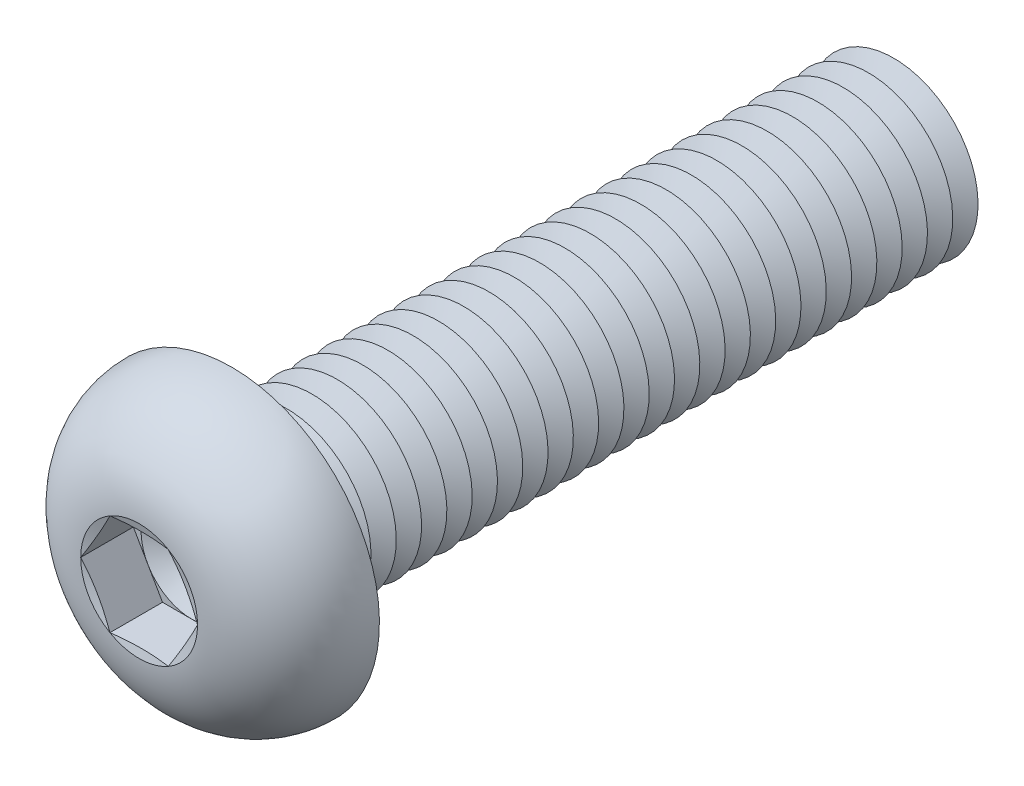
ISO-10303-21;
HEADER;
FILE_DESCRIPTION(('STEP AP214'),'2;1');
FILE_NAME('part.step','',(''),(''),'','','');
FILE_SCHEMA(('AUTOMOTIVE_DESIGN { 1 0 10303 214 1 1 1 1 }'));
ENDSEC;
DATA;
#1=APPLICATION_CONTEXT('core data for automotive mechanical design processes');
#2=APPLICATION_PROTOCOL_DEFINITION('international standard','automotive_design',2000,#1);
#3=PRODUCT_CONTEXT('',#1,'mechanical');
#4=PRODUCT('Part','Part','',(#3));
#5=PRODUCT_RELATED_PRODUCT_CATEGORY('part','',(#4));
#6=PRODUCT_DEFINITION_FORMATION('','',#4);
#7=PRODUCT_DEFINITION_CONTEXT('part definition',#1,'design');
#8=PRODUCT_DEFINITION('design','',#6,#7);
#9=PRODUCT_DEFINITION_SHAPE('','',#8);
#10=(LENGTH_UNIT() NAMED_UNIT(*) SI_UNIT(.MILLI.,.METRE.));
#11=(NAMED_UNIT(*) PLANE_ANGLE_UNIT() SI_UNIT($,.RADIAN.));
#12=(NAMED_UNIT(*) SI_UNIT($,.STERADIAN.) SOLID_ANGLE_UNIT());
#13=UNCERTAINTY_MEASURE_WITH_UNIT(LENGTH_MEASURE(1.E-05),#10,'distance_accuracy_value','');
#14=(GEOMETRIC_REPRESENTATION_CONTEXT(3) GLOBAL_UNCERTAINTY_ASSIGNED_CONTEXT((#13)) GLOBAL_UNIT_ASSIGNED_CONTEXT((#10,
#11,#12)) REPRESENTATION_CONTEXT('',''));
#15=CARTESIAN_POINT('',(0.,0.,0.));
#16=DIRECTION('',(0.,0.,1.));
#17=DIRECTION('',(1.,0.,0.));
#18=AXIS2_PLACEMENT_3D('',#15,#16,#17);
#19=CARTESIAN_POINT('',(0.,0.,2.38));
#20=DIRECTION('',(0.,0.,1.));
#21=DIRECTION('',(1.,0.,0.));
#22=AXIS2_PLACEMENT_3D('',#19,#20,#21);
#23=PLANE('',#22);
#24=CARTESIAN_POINT('',(0.,0.,2.38));
#25=DIRECTION('',(0.,0.,1.));
#26=DIRECTION('',(1.,0.,0.));
#27=AXIS2_PLACEMENT_3D('',#24,#25,#26);
#28=CIRCLE('',#27,2.99999860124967);
#29=CARTESIAN_POINT('',(2.598075,1.49999930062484,2.38));
#30=VERTEX_POINT('',#29);
#31=CARTESIAN_POINT('',(0.,2.99999860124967,2.38));
#32=VERTEX_POINT('',#31);
#33=EDGE_CURVE('E118',#30,#32,#28,.T.);
#34=ORIENTED_EDGE('',*,*,#33,.F.);
#35=DIRECTION('',(-0.500000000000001,0.866025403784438,0.));
#36=VECTOR('',#35,1.);
#37=CARTESIAN_POINT('',(3.4641,0.,2.38));
#38=LINE('',#37,#36);
#39=CARTESIAN_POINT('',(1.73205,2.99999860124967,2.38));
#40=VERTEX_POINT('',#39);
#41=EDGE_CURVE('E125',#30,#40,#38,.T.);
#42=ORIENTED_EDGE('',*,*,#41,.T.);
#43=DIRECTION('',(-1.,0.,0.));
#44=VECTOR('',#43,1.);
#45=CARTESIAN_POINT('',(1.73205,2.99999860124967,2.38));
#46=LINE('',#45,#44);
#47=EDGE_CURVE('E136',#40,#32,#46,.T.);
#48=ORIENTED_EDGE('',*,*,#47,.T.);
#49=EDGE_LOOP('',(#34,#42,#48));
#50=FACE_BOUND('',#49,.T.);
#51=ADVANCED_FACE('F39',(#50),#23,.T.);
#52=CARTESIAN_POINT('',(0.,0.,2.38));
#53=DIRECTION('',(0.,0.,1.));
#54=DIRECTION('',(1.,0.,0.));
#55=AXIS2_PLACEMENT_3D('',#52,#53,#54);
#56=CIRCLE('',#55,2.99999860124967);
#57=CARTESIAN_POINT('',(-2.598075,1.49999930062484,2.38));
#58=VERTEX_POINT('',#57);
#59=EDGE_CURVE('E11',#32,#58,#56,.T.);
#60=ORIENTED_EDGE('',*,*,#59,.F.);
#61=CARTESIAN_POINT('',(-1.73205,2.99999860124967,2.38));
#62=VERTEX_POINT('',#61);
#63=EDGE_CURVE('E131',#32,#62,#46,.T.);
#64=ORIENTED_EDGE('',*,*,#63,.T.);
#65=DIRECTION('',(-0.5,-0.866025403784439,0.));
#66=VECTOR('',#65,1.);
#67=CARTESIAN_POINT('',(-1.73205,2.99999860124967,2.38));
#68=LINE('',#67,#66);
#69=EDGE_CURVE('E134',#62,#58,#68,.T.);
#70=ORIENTED_EDGE('',*,*,#69,.T.);
#71=EDGE_LOOP('',(#60,#64,#70));
#72=FACE_BOUND('',#71,.T.);
#73=ADVANCED_FACE('F130',(#72),#23,.T.);
#74=CARTESIAN_POINT('',(-2.598075,-1.49999930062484,2.38));
#75=VERTEX_POINT('',#74);
#76=EDGE_CURVE('E49',#58,#75,#56,.T.);
#77=ORIENTED_EDGE('',*,*,#76,.F.);
#78=CARTESIAN_POINT('',(-3.4641,0.,2.38));
#79=VERTEX_POINT('',#78);
#80=EDGE_CURVE('E143',#58,#79,#68,.T.);
#81=ORIENTED_EDGE('',*,*,#80,.T.);
#82=DIRECTION('',(0.5,-0.866025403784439,0.));
#83=VECTOR('',#82,1.);
#84=CARTESIAN_POINT('',(-3.4641,0.,2.38));
#85=LINE('',#84,#83);
#86=EDGE_CURVE('E152',#79,#75,#85,.T.);
#87=ORIENTED_EDGE('',*,*,#86,.T.);
#88=EDGE_LOOP('',(#77,#81,#87));
#89=FACE_BOUND('',#88,.T.);
#90=ADVANCED_FACE('F514',(#89),#23,.T.);
#91=CARTESIAN_POINT('',(0.,-2.99999860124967,2.38));
#92=VERTEX_POINT('',#91);
#93=EDGE_CURVE('E373',#75,#92,#56,.T.);
#94=ORIENTED_EDGE('',*,*,#93,.F.);
#95=CARTESIAN_POINT('',(-1.73205,-2.99999860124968,2.38));
#96=VERTEX_POINT('',#95);
#97=EDGE_CURVE('E151',#75,#96,#85,.T.);
#98=ORIENTED_EDGE('',*,*,#97,.T.);
#99=DIRECTION('',(1.,0.,0.));
#100=VECTOR('',#99,1.);
#101=CARTESIAN_POINT('',(-1.73205,-2.99999860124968,2.38));
#102=LINE('',#101,#100);
#103=EDGE_CURVE('E157',#96,#92,#102,.T.);
#104=ORIENTED_EDGE('',*,*,#103,.T.);
#105=EDGE_LOOP('',(#94,#98,#104));
#106=FACE_BOUND('',#105,.T.);
#107=ADVANCED_FACE('F372',(#106),#23,.T.);
#108=CARTESIAN_POINT('',(2.598075,-1.49999930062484,2.38));
#109=VERTEX_POINT('',#108);
#110=EDGE_CURVE('E56',#92,#109,#56,.T.);
#111=ORIENTED_EDGE('',*,*,#110,.F.);
#112=CARTESIAN_POINT('',(1.73205,-2.99999860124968,2.38));
#113=VERTEX_POINT('',#112);
#114=EDGE_CURVE('E156',#92,#113,#102,.T.);
#115=ORIENTED_EDGE('',*,*,#114,.T.);
#116=DIRECTION('',(0.5,0.866025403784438,0.));
#117=VECTOR('',#116,1.);
#118=CARTESIAN_POINT('',(1.73205,-2.99999860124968,2.38));
#119=LINE('',#118,#117);
#120=EDGE_CURVE('E162',#113,#109,#119,.T.);
#121=ORIENTED_EDGE('',*,*,#120,.T.);
#122=EDGE_LOOP('',(#111,#115,#121));
#123=FACE_BOUND('',#122,.T.);
#124=ADVANCED_FACE('F368',(#123),#23,.T.);
#125=CARTESIAN_POINT('',(0.,0.,5.5));
#126=DIRECTION('',(0.,0.,1.));
#127=DIRECTION('',(0.,-1.,0.));
#128=AXIS2_PLACEMENT_3D('',#125,#126,#127);
#129=CONICAL_SURFACE('',#128,3.4641,1.30899693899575);
#130=CARTESIAN_POINT('',(3.46421547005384,-0.000200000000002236,5.50003094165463));
#131=CARTESIAN_POINT('',(3.39227822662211,0.124398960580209,5.48074619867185));
#132=CARTESIAN_POINT('',(3.32021054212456,0.249223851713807,5.46323875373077));
#133=CARTESIAN_POINT('',(3.17582062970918,0.499314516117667,5.43247971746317));
#134=CARTESIAN_POINT('',(3.10349831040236,0.624580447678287,5.41922985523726));
#135=CARTESIAN_POINT('',(2.95903767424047,0.874793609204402,5.39775958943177));
#136=CARTESIAN_POINT('',(2.88690033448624,0.999739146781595,5.38951357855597));
#137=CARTESIAN_POINT('',(2.74253364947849,1.2497895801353,5.37845651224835));
#138=CARTESIAN_POINT('',(2.67030432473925,1.37489444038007,5.37564440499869));
#139=CARTESIAN_POINT('',(2.52584567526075,1.6251041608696,5.37564440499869));
#140=CARTESIAN_POINT('',(2.45361635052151,1.75020902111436,5.37845651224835));
#141=CARTESIAN_POINT('',(2.30924966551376,2.00025945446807,5.38951357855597));
#142=CARTESIAN_POINT('',(2.23711232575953,2.12520499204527,5.39775958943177));
#143=CARTESIAN_POINT('',(2.09265168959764,2.37541815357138,5.41922985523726));
#144=CARTESIAN_POINT('',(2.02032937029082,2.500684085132,5.43247971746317));
#145=CARTESIAN_POINT('',(1.87593945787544,2.75077474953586,5.46323875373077));
#146=CARTESIAN_POINT('',(1.80387177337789,2.87559964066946,5.48074619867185));
#147=CARTESIAN_POINT('',(1.73193452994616,3.00019860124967,5.50003094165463));
#148=B_SPLINE_CURVE_WITH_KNOTS('',3,(#130,#131,#132,#133,#134,#135,#136,#137,#138,#139,#140,
#141,#142,#143,#144,#145,#146,#147),.UNSPECIFIED.,.F.,.F.,(4,2,2,2,2,2,2,2,4),(0.,
0.435506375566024,0.871189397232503,1.3046235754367,1.7379738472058,2.1713241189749,
2.6047582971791,3.04044131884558,3.4759476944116),.UNSPECIFIED.);
#149=CARTESIAN_POINT('',(3.4641,0.,5.5));
#150=VERTEX_POINT('',#149);
#151=CARTESIAN_POINT('',(1.73204999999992,2.99999860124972,5.5));
#152=VERTEX_POINT('',#151);
#153=EDGE_CURVE('E229',#150,#152,#148,.T.);
#154=ORIENTED_EDGE('',*,*,#153,.F.);
#155=CARTESIAN_POINT('',(0.,0.,5.5));
#156=DIRECTION('',(0.,0.,-1.));
#157=DIRECTION('',(0.,1.,0.));
#158=AXIS2_PLACEMENT_3D('',#155,#156,#157);
#159=CIRCLE('',#158,3.4641);
#160=EDGE_CURVE('E307',#152,#150,#159,.T.);
#161=ORIENTED_EDGE('',*,*,#160,.F.);
#162=EDGE_LOOP('',(#154,#161));
#163=FACE_BOUND('',#162,.T.);
#164=ADVANCED_FACE('F391',(#163),#129,.F.);
#165=CARTESIAN_POINT('',(1.73193452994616,-3.00019860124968,5.50003094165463));
#166=CARTESIAN_POINT('',(1.80387177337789,-2.87559964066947,5.48074619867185));
#167=CARTESIAN_POINT('',(1.87593945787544,-2.75077474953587,5.46323875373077));
#168=CARTESIAN_POINT('',(2.02032937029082,-2.50068408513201,5.43247971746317));
#169=CARTESIAN_POINT('',(2.09265168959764,-2.37541815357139,5.41922985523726));
#170=CARTESIAN_POINT('',(2.23711232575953,-2.12520499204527,5.39775958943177));
#171=CARTESIAN_POINT('',(2.30924966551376,-2.00025945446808,5.38951357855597));
#172=CARTESIAN_POINT('',(2.45361635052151,-1.75020902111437,5.37845651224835));
#173=CARTESIAN_POINT('',(2.52584567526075,-1.6251041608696,5.37564440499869));
#174=CARTESIAN_POINT('',(2.67030432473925,-1.37489444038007,5.37564440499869));
#175=CARTESIAN_POINT('',(2.74253364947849,-1.24978958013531,5.37845651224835));
#176=CARTESIAN_POINT('',(2.88690033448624,-0.999739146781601,5.38951357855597));
#177=CARTESIAN_POINT('',(2.95903767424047,-0.874793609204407,5.39775958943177));
#178=CARTESIAN_POINT('',(3.10349831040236,-0.624580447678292,5.41922985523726));
#179=CARTESIAN_POINT('',(3.17582062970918,-0.499314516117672,5.43247971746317));
#180=CARTESIAN_POINT('',(3.32021054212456,-0.249223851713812,5.46323875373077));
#181=CARTESIAN_POINT('',(3.39227822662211,-0.124398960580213,5.48074619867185));
#182=CARTESIAN_POINT('',(3.46421547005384,0.000199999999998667,5.50003094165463));
#183=B_SPLINE_CURVE_WITH_KNOTS('',3,(#165,#166,#167,#168,#169,#170,#171,#172,#173,#174,#175,
#176,#177,#178,#179,#180,#181,#182),.UNSPECIFIED.,.F.,.F.,(4,2,2,2,2,2,2,2,4),(0.,
0.435506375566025,0.871189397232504,1.3046235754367,1.7379738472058,2.1713241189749,
2.6047582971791,3.04044131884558,3.4759476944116),.UNSPECIFIED.);
#184=CARTESIAN_POINT('',(1.73205,-2.99999860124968,5.5));
#185=VERTEX_POINT('',#184);
#186=EDGE_CURVE('E232',#185,#150,#183,.T.);
#187=ORIENTED_EDGE('',*,*,#186,.F.);
#188=EDGE_CURVE('E290',#150,#185,#159,.T.);
#189=ORIENTED_EDGE('',*,*,#188,.F.);
#190=EDGE_LOOP('',(#187,#189));
#191=FACE_BOUND('',#190,.T.);
#192=ADVANCED_FACE('F288',(#191),#129,.F.);
#193=CARTESIAN_POINT('',(-5.2273006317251,-2.99999860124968,6.18672552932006));
#194=CARTESIAN_POINT('',(-5.10075887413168,-2.99999860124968,6.1573201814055));
#195=CARTESIAN_POINT('',(-4.97415993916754,-2.99999860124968,6.12816064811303));
#196=CARTESIAN_POINT('',(-4.72082394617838,-2.99999860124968,6.07043857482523));
#197=CARTESIAN_POINT('',(-4.59408688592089,-2.99999860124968,6.04187604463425));
#198=CARTESIAN_POINT('',(-4.21358997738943,-2.99999860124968,5.95723252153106));
#199=CARTESIAN_POINT('',(-3.95959339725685,-2.99999860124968,5.90220706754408));
#200=CARTESIAN_POINT('',(-3.44835573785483,-2.99999860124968,5.79574115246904));
#201=CARTESIAN_POINT('',(-3.19110656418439,-2.99999860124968,5.744339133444));
#202=CARTESIAN_POINT('',(-2.67540790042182,-2.99999860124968,5.64772994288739));
#203=CARTESIAN_POINT('',(-2.41695830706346,-2.99999860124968,5.60252331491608));
#204=CARTESIAN_POINT('',(-1.9055512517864,-2.99999860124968,5.52251897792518));
#205=CARTESIAN_POINT('',(-1.65263426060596,-2.99999860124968,5.48747285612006));
#206=CARTESIAN_POINT('',(-1.27220564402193,-2.99999860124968,5.44439602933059));
#207=CARTESIAN_POINT('',(-1.1452320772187,-2.99999860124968,5.43161987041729));
#208=CARTESIAN_POINT('',(-0.890973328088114,-2.99999860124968,5.40972605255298));
#209=CARTESIAN_POINT('',(-0.763688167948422,-2.99999860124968,5.40060814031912));
#210=CARTESIAN_POINT('',(-0.509442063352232,-2.99999860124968,5.38647457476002));
#211=CARTESIAN_POINT('',(-0.382482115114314,-2.99999860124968,5.38144125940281));
#212=CARTESIAN_POINT('',(-0.128463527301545,-2.99999860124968,5.37566637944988));
#213=CARTESIAN_POINT('',(-0.0014048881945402,-2.99999860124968,5.37492479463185));
#214=CARTESIAN_POINT('',(0.252672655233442,-2.99999860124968,5.37777315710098));
#215=CARTESIAN_POINT('',(0.379691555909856,-2.99999860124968,5.38136342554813));
#216=CARTESIAN_POINT('',(0.633540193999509,-2.99999860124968,5.39268816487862));
#217=CARTESIAN_POINT('',(0.76036993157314,-2.99999860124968,5.40042263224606));
#218=CARTESIAN_POINT('',(1.06836981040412,-2.99999860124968,5.42382465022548));
#219=CARTESIAN_POINT('',(1.24938929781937,-2.99999860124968,5.4414748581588));
#220=CARTESIAN_POINT('',(1.61066786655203,-2.99999860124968,5.48312309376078));
#221=CARTESIAN_POINT('',(1.7909269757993,-2.99999860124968,5.50712088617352));
#222=CARTESIAN_POINT('',(2.15127612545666,-2.99999860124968,5.56013471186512));
#223=CARTESIAN_POINT('',(2.33136383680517,-2.99999860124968,5.58916634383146));
#224=CARTESIAN_POINT('',(2.690892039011,-2.99999860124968,5.65100028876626));
#225=CARTESIAN_POINT('',(2.87033249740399,-2.99999860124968,5.6838027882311));
#226=CARTESIAN_POINT('',(3.23235399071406,-2.99999860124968,5.75295369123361));
#227=CARTESIAN_POINT('',(3.4149236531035,-2.99999860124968,5.78936117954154));
#228=CARTESIAN_POINT('',(3.77960351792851,-2.99999860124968,5.86440648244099));
#229=CARTESIAN_POINT('',(3.96171371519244,-2.99999860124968,5.903044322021));
#230=CARTESIAN_POINT('',(4.32457472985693,-2.99999860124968,5.98179660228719));
#231=CARTESIAN_POINT('',(4.5053275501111,-2.99999860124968,6.02190185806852));
#232=CARTESIAN_POINT('',(4.86652484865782,-2.99999860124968,6.10342152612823));
#233=CARTESIAN_POINT('',(5.04696934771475,-2.99999860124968,6.14483584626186));
#234=CARTESIAN_POINT('',(5.2273006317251,-2.99999860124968,6.18672552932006));
#235=B_SPLINE_CURVE_WITH_KNOTS('',3,(#193,#194,#195,#196,#197,#198,#199,#200,#201,#202,#203,
#204,#205,#206,#207,#208,#209,#210,#211,#212,#213,#214,#215,#216,#217,#218,#219,#220,#221,#222,
#223,#224,#225,#226,#227,#228,#229,#230,#231,#232,#233,#234),.UNSPECIFIED.,.F.,.F.,(4,2,2,2,2,2,
2,2,2,2,2,2,2,2,2,2,2,2,2,2,4),(0.,0.389739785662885,0.779485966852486,1.5591292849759,
2.34608117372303,3.13310206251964,3.8988410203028,4.28164148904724,4.66441544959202,
5.04552531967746,5.42663339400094,5.80776972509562,6.18890573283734,6.73438998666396,
7.27985402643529,7.8270395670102,8.37425218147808,8.93272720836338,9.49120849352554,
10.0466490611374,10.6020506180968),.UNSPECIFIED.);
#236=CARTESIAN_POINT('',(-1.73205,-2.99999860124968,5.5));
#237=VERTEX_POINT('',#236);
#238=EDGE_CURVE('E241',#237,#185,#235,.T.);
#239=ORIENTED_EDGE('',*,*,#238,.F.);
#240=EDGE_CURVE('E295',#185,#237,#159,.T.);
#241=ORIENTED_EDGE('',*,*,#240,.F.);
#242=EDGE_LOOP('',(#239,#241));
#243=FACE_BOUND('',#242,.T.);
#244=ADVANCED_FACE('F296',(#243),#129,.F.);
#245=CARTESIAN_POINT('',(-3.46421547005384,0.000199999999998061,5.50003094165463));
#246=CARTESIAN_POINT('',(-3.39227822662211,-0.124398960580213,5.48074619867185));
#247=CARTESIAN_POINT('',(-3.32021054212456,-0.249223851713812,5.46323875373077));
#248=CARTESIAN_POINT('',(-3.17582062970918,-0.499314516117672,5.43247971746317));
#249=CARTESIAN_POINT('',(-3.10349831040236,-0.624580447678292,5.41922985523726));
#250=CARTESIAN_POINT('',(-2.95903767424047,-0.874793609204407,5.39775958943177));
#251=CARTESIAN_POINT('',(-2.88690033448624,-0.999739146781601,5.38951357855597));
#252=CARTESIAN_POINT('',(-2.74253364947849,-1.24978958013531,5.37845651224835));
#253=CARTESIAN_POINT('',(-2.67030432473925,-1.37489444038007,5.37564440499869));
#254=CARTESIAN_POINT('',(-2.52584567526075,-1.6251041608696,5.37564440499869));
#255=CARTESIAN_POINT('',(-2.45361635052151,-1.75020902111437,5.37845651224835));
#256=CARTESIAN_POINT('',(-2.30924966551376,-2.00025945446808,5.38951357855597));
#257=CARTESIAN_POINT('',(-2.23711232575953,-2.12520499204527,5.39775958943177));
#258=CARTESIAN_POINT('',(-2.09265168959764,-2.37541815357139,5.41922985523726));
#259=CARTESIAN_POINT('',(-2.02032937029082,-2.50068408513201,5.43247971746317));
#260=CARTESIAN_POINT('',(-1.87593945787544,-2.75077474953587,5.46323875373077));
#261=CARTESIAN_POINT('',(-1.80387177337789,-2.87559964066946,5.48074619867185));
#262=CARTESIAN_POINT('',(-1.73193452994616,-3.00019860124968,5.50003094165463));
#263=B_SPLINE_CURVE_WITH_KNOTS('',3,(#245,#246,#247,#248,#249,#250,#251,#252,#253,#254,#255,
#256,#257,#258,#259,#260,#261,#262),.UNSPECIFIED.,.F.,.F.,(4,2,2,2,2,2,2,2,4),(0.,
0.435506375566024,0.871189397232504,1.3046235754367,1.7379738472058,2.1713241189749,
2.6047582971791,3.04044131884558,3.4759476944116),.UNSPECIFIED.);
#264=CARTESIAN_POINT('',(-3.4641,0.,5.5));
#265=VERTEX_POINT('',#264);
#266=EDGE_CURVE('E236',#265,#237,#263,.T.);
#267=ORIENTED_EDGE('',*,*,#266,.F.);
#268=EDGE_CURVE('E301',#237,#265,#159,.T.);
#269=ORIENTED_EDGE('',*,*,#268,.F.);
#270=EDGE_LOOP('',(#267,#269));
#271=FACE_BOUND('',#270,.T.);
#272=ADVANCED_FACE('F382',(#271),#129,.F.);
#273=CARTESIAN_POINT('',(-1.73193452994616,3.00019860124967,5.50003094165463));
#274=CARTESIAN_POINT('',(-1.8038717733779,2.87559964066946,5.48074619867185));
#275=CARTESIAN_POINT('',(-1.87593945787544,2.75077474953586,5.46323875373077));
#276=CARTESIAN_POINT('',(-2.02032937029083,2.500684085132,5.43247971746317));
#277=CARTESIAN_POINT('',(-2.09265168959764,2.37541815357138,5.41922985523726));
#278=CARTESIAN_POINT('',(-2.23711232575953,2.12520499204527,5.39775958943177));
#279=CARTESIAN_POINT('',(-2.30924966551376,2.00025945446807,5.38951357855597));
#280=CARTESIAN_POINT('',(-2.45361635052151,1.75020902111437,5.37845651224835));
#281=CARTESIAN_POINT('',(-2.52584567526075,1.6251041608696,5.37564440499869));
#282=CARTESIAN_POINT('',(-2.67030432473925,1.37489444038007,5.37564440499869));
#283=CARTESIAN_POINT('',(-2.74253364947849,1.2497895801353,5.37845651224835));
#284=CARTESIAN_POINT('',(-2.88690033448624,0.999739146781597,5.38951357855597));
#285=CARTESIAN_POINT('',(-2.95903767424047,0.874793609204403,5.39775958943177));
#286=CARTESIAN_POINT('',(-3.10349831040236,0.624580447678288,5.41922985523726));
#287=CARTESIAN_POINT('',(-3.17582062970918,0.499314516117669,5.43247971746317));
#288=CARTESIAN_POINT('',(-3.32021054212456,0.249223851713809,5.46323875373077));
#289=CARTESIAN_POINT('',(-3.39227822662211,0.12439896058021,5.48074619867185));
#290=CARTESIAN_POINT('',(-3.46421547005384,-0.000200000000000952,5.50003094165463));
#291=B_SPLINE_CURVE_WITH_KNOTS('',3,(#273,#274,#275,#276,#277,#278,#279,#280,#281,#282,#283,
#284,#285,#286,#287,#288,#289,#290),.UNSPECIFIED.,.F.,.F.,(4,2,2,2,2,2,2,2,4),(0.,
0.435506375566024,0.871189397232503,1.3046235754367,1.7379738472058,2.1713241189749,
2.6047582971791,3.04044131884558,3.4759476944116),.UNSPECIFIED.);
#292=CARTESIAN_POINT('',(-1.73205,2.99999860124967,5.5));
#293=VERTEX_POINT('',#292);
#294=EDGE_CURVE('E234',#293,#265,#291,.T.);
#295=ORIENTED_EDGE('',*,*,#294,.F.);
#296=EDGE_CURVE('E319',#265,#293,#159,.T.);
#297=ORIENTED_EDGE('',*,*,#296,.F.);
#298=EDGE_LOOP('',(#295,#297));
#299=FACE_BOUND('',#298,.T.);
#300=ADVANCED_FACE('F385',(#299),#129,.F.);
#301=CARTESIAN_POINT('',(0.,0.,-34.75));
#302=DIRECTION('',(0.,0.,1.));
#303=DIRECTION('',(0.,-1.,0.));
#304=AXIS2_PLACEMENT_3D('',#301,#302,#303);
#305=CONICAL_SURFACE('',#304,4.99999999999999,1.0471975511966);
#306=CARTESIAN_POINT('',(0.,0.,-35.5));
#307=DIRECTION('',(0.,0.,1.));
#308=DIRECTION('',(0.,-1.,0.));
#309=AXIS2_PLACEMENT_3D('',#306,#307,#308);
#310=CIRCLE('',#309,3.70096189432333);
#311=CARTESIAN_POINT('',(0.,-3.70096189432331,-35.5));
#312=VERTEX_POINT('',#311);
#313=EDGE_CURVE('E365',#312,#312,#310,.T.);
#314=ORIENTED_EDGE('',*,*,#313,.T.);
#315=EDGE_LOOP('',(#314));
#316=FACE_BOUND('',#315,.T.);
#317=CARTESIAN_POINT('',(0.,0.,-34.75));
#318=DIRECTION('',(0.,0.,1.));
#319=DIRECTION('',(0.,-1.,0.));
#320=AXIS2_PLACEMENT_3D('',#317,#318,#319);
#321=CIRCLE('',#320,4.99999999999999);
#322=CARTESIAN_POINT('',(0.,-4.99999999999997,-34.75));
#323=VERTEX_POINT('',#322);
#324=EDGE_CURVE('E478',#323,#323,#321,.T.);
#325=ORIENTED_EDGE('',*,*,#324,.F.);
#326=EDGE_LOOP('',(#325));
#327=FACE_BOUND('',#326,.T.);
#328=ADVANCED_FACE('F574',(#316,#327),#305,.T.);
#329=CARTESIAN_POINT('',(0.,0.,-35.5));
#330=DIRECTION('',(0.,0.,-1.));
#331=DIRECTION('',(0.,1.,0.));
#332=AXIS2_PLACEMENT_3D('',#329,#330,#331);
#333=CONICAL_SURFACE('',#332,3.70096189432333,1.0471975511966);
#334=CARTESIAN_POINT('',(0.,0.,-36.25));
#335=DIRECTION('',(0.,0.,1.));
#336=DIRECTION('',(0.,-1.,0.));
#337=AXIS2_PLACEMENT_3D('',#334,#335,#336);
#338=CIRCLE('',#337,4.99999999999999);
#339=CARTESIAN_POINT('',(0.,-4.99999999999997,-36.25));
#340=VERTEX_POINT('',#339);
#341=EDGE_CURVE('E361',#340,#340,#338,.T.);
#342=ORIENTED_EDGE('',*,*,#341,.T.);
#343=EDGE_LOOP('',(#342));
#344=FACE_BOUND('',#343,.T.);
#345=ORIENTED_EDGE('',*,*,#313,.F.);
#346=EDGE_LOOP('',(#345));
#347=FACE_BOUND('',#346,.T.);
#348=ADVANCED_FACE('F1096',(#344,#347),#333,.T.);
#349=CARTESIAN_POINT('',(0.,5.,-40.));
#350=DIRECTION('',(0.,0.,-1.));
#351=DIRECTION('',(0.,1.,0.));
#352=AXIS2_PLACEMENT_3D('',#349,#350,#351);
#353=PLANE('',#352);
#354=CARTESIAN_POINT('',(0.,0.,-40.));
#355=DIRECTION('',(0.,0.,1.));
#356=DIRECTION('',(0.,-1.,0.));
#357=AXIS2_PLACEMENT_3D('',#354,#355,#356);
#358=CIRCLE('',#357,3.70096189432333);
#359=CARTESIAN_POINT('',(0.,-3.70096189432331,-40.));
#360=VERTEX_POINT('',#359);
#361=EDGE_CURVE('E326',#360,#360,#358,.T.);
#362=ORIENTED_EDGE('',*,*,#361,.F.);
#363=EDGE_LOOP('',(#362));
#364=FACE_BOUND('',#363,.T.);
#365=ADVANCED_FACE('F1101',(#364),#353,.T.);
#366=CARTESIAN_POINT('',(0.,0.,-39.25));
#367=DIRECTION('',(0.,0.,1.));
#368=DIRECTION('',(0.,-1.,0.));
#369=AXIS2_PLACEMENT_3D('',#366,#367,#368);
#370=CONICAL_SURFACE('',#369,4.99999999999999,1.0471975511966);
#371=ORIENTED_EDGE('',*,*,#361,.T.);
#372=EDGE_LOOP('',(#371));
#373=FACE_BOUND('',#372,.T.);
#374=CARTESIAN_POINT('',(0.,0.,-39.25));
#375=DIRECTION('',(0.,0.,1.));
#376=DIRECTION('',(0.,-1.,0.));
#377=AXIS2_PLACEMENT_3D('',#374,#375,#376);
#378=CIRCLE('',#377,4.99999999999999);
#379=CARTESIAN_POINT('',(0.,-4.99999999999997,-39.25));
#380=VERTEX_POINT('',#379);
#381=EDGE_CURVE('E358',#380,#380,#378,.T.);
#382=ORIENTED_EDGE('',*,*,#381,.F.);
#383=EDGE_LOOP('',(#382));
#384=FACE_BOUND('',#383,.T.);
#385=ADVANCED_FACE('F1089',(#373,#384),#370,.T.);
#386=CARTESIAN_POINT('',(0.,0.,-38.5));
#387=DIRECTION('',(0.,0.,-1.));
#388=DIRECTION('',(0.,1.,0.));
#389=AXIS2_PLACEMENT_3D('',#386,#387,#388);
#390=CONICAL_SURFACE('',#389,3.70096189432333,1.0471975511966);
#391=ORIENTED_EDGE('',*,*,#381,.T.);
#392=EDGE_LOOP('',(#391));
#393=FACE_BOUND('',#392,.T.);
#394=CARTESIAN_POINT('',(0.,0.,-38.5));
#395=DIRECTION('',(0.,0.,1.));
#396=DIRECTION('',(0.,-1.,0.));
#397=AXIS2_PLACEMENT_3D('',#394,#395,#396);
#398=CIRCLE('',#397,3.70096189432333);
#399=CARTESIAN_POINT('',(0.,-3.70096189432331,-38.5));
#400=VERTEX_POINT('',#399);
#401=EDGE_CURVE('E355',#400,#400,#398,.T.);
#402=ORIENTED_EDGE('',*,*,#401,.F.);
#403=EDGE_LOOP('',(#402));
#404=FACE_BOUND('',#403,.T.);
#405=ADVANCED_FACE('F1079',(#393,#404),#390,.T.);
#406=CARTESIAN_POINT('',(0.,0.,-37.75));
#407=DIRECTION('',(0.,0.,1.));
#408=DIRECTION('',(0.,-1.,0.));
#409=AXIS2_PLACEMENT_3D('',#406,#407,#408);
#410=CONICAL_SURFACE('',#409,4.99999999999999,1.0471975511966);
#411=ORIENTED_EDGE('',*,*,#401,.T.);
#412=EDGE_LOOP('',(#411));
#413=FACE_BOUND('',#412,.T.);
#414=CARTESIAN_POINT('',(0.,0.,-37.75));
#415=DIRECTION('',(0.,0.,1.));
#416=DIRECTION('',(0.,-1.,0.));
#417=AXIS2_PLACEMENT_3D('',#414,#415,#416);
#418=CIRCLE('',#417,4.99999999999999);
#419=CARTESIAN_POINT('',(0.,-4.99999999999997,-37.75));
#420=VERTEX_POINT('',#419);
#421=EDGE_CURVE('E359',#420,#420,#418,.T.);
#422=ORIENTED_EDGE('',*,*,#421,.F.);
#423=EDGE_LOOP('',(#422));
#424=FACE_BOUND('',#423,.T.);
#425=ADVANCED_FACE('F1069',(#413,#424),#410,.T.);
#426=CARTESIAN_POINT('',(0.,0.,-37.));
#427=DIRECTION('',(0.,0.,-1.));
#428=DIRECTION('',(0.,1.,0.));
#429=AXIS2_PLACEMENT_3D('',#426,#427,#428);
#430=CONICAL_SURFACE('',#429,3.70096189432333,1.0471975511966);
#431=ORIENTED_EDGE('',*,*,#421,.T.);
#432=EDGE_LOOP('',(#431));
#433=FACE_BOUND('',#432,.T.);
#434=CARTESIAN_POINT('',(0.,0.,-37.));
#435=DIRECTION('',(0.,0.,1.));
#436=DIRECTION('',(0.,-1.,0.));
#437=AXIS2_PLACEMENT_3D('',#434,#435,#436);
#438=CIRCLE('',#437,3.70096189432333);
#439=CARTESIAN_POINT('',(0.,-3.70096189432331,-37.));
#440=VERTEX_POINT('',#439);
#441=EDGE_CURVE('E364',#440,#440,#438,.T.);
#442=ORIENTED_EDGE('',*,*,#441,.F.);
#443=EDGE_LOOP('',(#442));
#444=FACE_BOUND('',#443,.T.);
#445=ADVANCED_FACE('F1059',(#433,#444),#430,.T.);
#446=CARTESIAN_POINT('',(0.,0.,-36.25));
#447=DIRECTION('',(0.,0.,1.));
#448=DIRECTION('',(0.,-1.,0.));
#449=AXIS2_PLACEMENT_3D('',#446,#447,#448);
#450=CONICAL_SURFACE('',#449,4.99999999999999,1.0471975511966);
#451=ORIENTED_EDGE('',*,*,#441,.T.);
#452=EDGE_LOOP('',(#451));
#453=FACE_BOUND('',#452,.T.);
#454=ORIENTED_EDGE('',*,*,#341,.F.);
#455=EDGE_LOOP('',(#454));
#456=FACE_BOUND('',#455,.T.);
#457=ADVANCED_FACE('F1049',(#453,#456),#450,.T.);
#458=CARTESIAN_POINT('',(0.,0.,-33.25));
#459=DIRECTION('',(0.,0.,1.));
#460=DIRECTION('',(0.,-1.,0.));
#461=AXIS2_PLACEMENT_3D('',#458,#459,#460);
#462=CONICAL_SURFACE('',#461,4.99999999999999,1.0471975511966);
#463=CARTESIAN_POINT('',(0.,0.,-34.));
#464=DIRECTION('',(0.,0.,1.));
#465=DIRECTION('',(0.,-1.,0.));
#466=AXIS2_PLACEMENT_3D('',#463,#464,#465);
#467=CIRCLE('',#466,3.70096189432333);
#468=CARTESIAN_POINT('',(0.,-3.70096189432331,-34.));
#469=VERTEX_POINT('',#468);
#470=EDGE_CURVE('E474',#469,#469,#467,.T.);
#471=ORIENTED_EDGE('',*,*,#470,.T.);
#472=EDGE_LOOP('',(#471));
#473=FACE_BOUND('',#472,.T.);
#474=CARTESIAN_POINT('',(0.,0.,-33.25));
#475=DIRECTION('',(0.,0.,1.));
#476=DIRECTION('',(0.,-1.,0.));
#477=AXIS2_PLACEMENT_3D('',#474,#475,#476);
#478=CIRCLE('',#477,4.99999999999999);
#479=CARTESIAN_POINT('',(0.,-4.99999999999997,-33.25));
#480=VERTEX_POINT('',#479);
#481=EDGE_CURVE('E470',#480,#480,#478,.T.);
#482=ORIENTED_EDGE('',*,*,#481,.F.);
#483=EDGE_LOOP('',(#482));
#484=FACE_BOUND('',#483,.T.);
#485=ADVANCED_FACE('F1039',(#473,#484),#462,.T.);
#486=CARTESIAN_POINT('',(0.,0.,-34.));
#487=DIRECTION('',(0.,0.,-1.));
#488=DIRECTION('',(0.,1.,0.));
#489=AXIS2_PLACEMENT_3D('',#486,#487,#488);
#490=CONICAL_SURFACE('',#489,3.70096189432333,1.0471975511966);
#491=ORIENTED_EDGE('',*,*,#324,.T.);
#492=EDGE_LOOP('',(#491));
#493=FACE_BOUND('',#492,.T.);
#494=ORIENTED_EDGE('',*,*,#470,.F.);
#495=EDGE_LOOP('',(#494));
#496=FACE_BOUND('',#495,.T.);
#497=ADVANCED_FACE('F1029',(#493,#496),#490,.T.);
#498=CARTESIAN_POINT('',(0.,0.,-31.75));
#499=DIRECTION('',(0.,0.,1.));
#500=DIRECTION('',(0.,-1.,0.));
#501=AXIS2_PLACEMENT_3D('',#498,#499,#500);
#502=CONICAL_SURFACE('',#501,4.99999999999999,1.0471975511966);
#503=CARTESIAN_POINT('',(0.,0.,-32.5));
#504=DIRECTION('',(0.,0.,1.));
#505=DIRECTION('',(0.,-1.,0.));
#506=AXIS2_PLACEMENT_3D('',#503,#504,#505);
#507=CIRCLE('',#506,3.70096189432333);
#508=CARTESIAN_POINT('',(0.,-3.70096189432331,-32.5));
#509=VERTEX_POINT('',#508);
#510=EDGE_CURVE('E466',#509,#509,#507,.T.);
#511=ORIENTED_EDGE('',*,*,#510,.T.);
#512=EDGE_LOOP('',(#511));
#513=FACE_BOUND('',#512,.T.);
#514=CARTESIAN_POINT('',(0.,0.,-31.75));
#515=DIRECTION('',(0.,0.,1.));
#516=DIRECTION('',(0.,-1.,0.));
#517=AXIS2_PLACEMENT_3D('',#514,#515,#516);
#518=CIRCLE('',#517,4.99999999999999);
#519=CARTESIAN_POINT('',(0.,-4.99999999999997,-31.75));
#520=VERTEX_POINT('',#519);
#521=EDGE_CURVE('E462',#520,#520,#518,.T.);
#522=ORIENTED_EDGE('',*,*,#521,.F.);
#523=EDGE_LOOP('',(#522));
#524=FACE_BOUND('',#523,.T.);
#525=ADVANCED_FACE('F1019',(#513,#524),#502,.T.);
#526=CARTESIAN_POINT('',(0.,0.,-32.5));
#527=DIRECTION('',(0.,0.,-1.));
#528=DIRECTION('',(0.,1.,0.));
#529=AXIS2_PLACEMENT_3D('',#526,#527,#528);
#530=CONICAL_SURFACE('',#529,3.70096189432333,1.0471975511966);
#531=ORIENTED_EDGE('',*,*,#481,.T.);
#532=EDGE_LOOP('',(#531));
#533=FACE_BOUND('',#532,.T.);
#534=ORIENTED_EDGE('',*,*,#510,.F.);
#535=EDGE_LOOP('',(#534));
#536=FACE_BOUND('',#535,.T.);
#537=ADVANCED_FACE('F1009',(#533,#536),#530,.T.);
#538=CARTESIAN_POINT('',(0.,0.,-30.25));
#539=DIRECTION('',(0.,0.,1.));
#540=DIRECTION('',(0.,-1.,0.));
#541=AXIS2_PLACEMENT_3D('',#538,#539,#540);
#542=CONICAL_SURFACE('',#541,4.99999999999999,1.0471975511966);
#543=CARTESIAN_POINT('',(0.,0.,-31.));
#544=DIRECTION('',(0.,0.,1.));
#545=DIRECTION('',(0.,-1.,0.));
#546=AXIS2_PLACEMENT_3D('',#543,#544,#545);
#547=CIRCLE('',#546,3.70096189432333);
#548=CARTESIAN_POINT('',(0.,-3.70096189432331,-31.));
#549=VERTEX_POINT('',#548);
#550=EDGE_CURVE('E458',#549,#549,#547,.T.);
#551=ORIENTED_EDGE('',*,*,#550,.T.);
#552=EDGE_LOOP('',(#551));
#553=FACE_BOUND('',#552,.T.);
#554=CARTESIAN_POINT('',(0.,0.,-30.25));
#555=DIRECTION('',(0.,0.,1.));
#556=DIRECTION('',(0.,-1.,0.));
#557=AXIS2_PLACEMENT_3D('',#554,#555,#556);
#558=CIRCLE('',#557,4.99999999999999);
#559=CARTESIAN_POINT('',(0.,-4.99999999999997,-30.25));
#560=VERTEX_POINT('',#559);
#561=EDGE_CURVE('E454',#560,#560,#558,.T.);
#562=ORIENTED_EDGE('',*,*,#561,.F.);
#563=EDGE_LOOP('',(#562));
#564=FACE_BOUND('',#563,.T.);
#565=ADVANCED_FACE('F999',(#553,#564),#542,.T.);
#566=CARTESIAN_POINT('',(0.,0.,-31.));
#567=DIRECTION('',(0.,0.,-1.));
#568=DIRECTION('',(0.,1.,0.));
#569=AXIS2_PLACEMENT_3D('',#566,#567,#568);
#570=CONICAL_SURFACE('',#569,3.70096189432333,1.0471975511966);
#571=ORIENTED_EDGE('',*,*,#521,.T.);
#572=EDGE_LOOP('',(#571));
#573=FACE_BOUND('',#572,.T.);
#574=ORIENTED_EDGE('',*,*,#550,.F.);
#575=EDGE_LOOP('',(#574));
#576=FACE_BOUND('',#575,.T.);
#577=ADVANCED_FACE('F989',(#573,#576),#570,.T.);
#578=CARTESIAN_POINT('',(0.,0.,-28.75));
#579=DIRECTION('',(0.,0.,1.));
#580=DIRECTION('',(0.,-1.,0.));
#581=AXIS2_PLACEMENT_3D('',#578,#579,#580);
#582=CONICAL_SURFACE('',#581,4.99999999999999,1.0471975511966);
#583=CARTESIAN_POINT('',(0.,0.,-29.5));
#584=DIRECTION('',(0.,0.,1.));
#585=DIRECTION('',(0.,-1.,0.));
#586=AXIS2_PLACEMENT_3D('',#583,#584,#585);
#587=CIRCLE('',#586,3.70096189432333);
#588=CARTESIAN_POINT('',(0.,-3.70096189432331,-29.5));
#589=VERTEX_POINT('',#588);
#590=EDGE_CURVE('E450',#589,#589,#587,.T.);
#591=ORIENTED_EDGE('',*,*,#590,.T.);
#592=EDGE_LOOP('',(#591));
#593=FACE_BOUND('',#592,.T.);
#594=CARTESIAN_POINT('',(0.,0.,-28.75));
#595=DIRECTION('',(0.,0.,1.));
#596=DIRECTION('',(0.,-1.,0.));
#597=AXIS2_PLACEMENT_3D('',#594,#595,#596);
#598=CIRCLE('',#597,4.99999999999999);
#599=CARTESIAN_POINT('',(0.,-4.99999999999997,-28.75));
#600=VERTEX_POINT('',#599);
#601=EDGE_CURVE('E446',#600,#600,#598,.T.);
#602=ORIENTED_EDGE('',*,*,#601,.F.);
#603=EDGE_LOOP('',(#602));
#604=FACE_BOUND('',#603,.T.);
#605=ADVANCED_FACE('F979',(#593,#604),#582,.T.);
#606=CARTESIAN_POINT('',(0.,0.,-29.5));
#607=DIRECTION('',(0.,0.,-1.));
#608=DIRECTION('',(0.,1.,0.));
#609=AXIS2_PLACEMENT_3D('',#606,#607,#608);
#610=CONICAL_SURFACE('',#609,3.70096189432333,1.0471975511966);
#611=ORIENTED_EDGE('',*,*,#561,.T.);
#612=EDGE_LOOP('',(#611));
#613=FACE_BOUND('',#612,.T.);
#614=ORIENTED_EDGE('',*,*,#590,.F.);
#615=EDGE_LOOP('',(#614));
#616=FACE_BOUND('',#615,.T.);
#617=ADVANCED_FACE('F969',(#613,#616),#610,.T.);
#618=CARTESIAN_POINT('',(0.,0.,-27.25));
#619=DIRECTION('',(0.,0.,1.));
#620=DIRECTION('',(0.,-1.,0.));
#621=AXIS2_PLACEMENT_3D('',#618,#619,#620);
#622=CONICAL_SURFACE('',#621,4.99999999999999,1.0471975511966);
#623=CARTESIAN_POINT('',(0.,0.,-28.));
#624=DIRECTION('',(0.,0.,1.));
#625=DIRECTION('',(0.,-1.,0.));
#626=AXIS2_PLACEMENT_3D('',#623,#624,#625);
#627=CIRCLE('',#626,3.70096189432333);
#628=CARTESIAN_POINT('',(0.,-3.70096189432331,-28.));
#629=VERTEX_POINT('',#628);
#630=EDGE_CURVE('E442',#629,#629,#627,.T.);
#631=ORIENTED_EDGE('',*,*,#630,.T.);
#632=EDGE_LOOP('',(#631));
#633=FACE_BOUND('',#632,.T.);
#634=CARTESIAN_POINT('',(0.,0.,-27.25));
#635=DIRECTION('',(0.,0.,1.));
#636=DIRECTION('',(0.,-1.,0.));
#637=AXIS2_PLACEMENT_3D('',#634,#635,#636);
#638=CIRCLE('',#637,4.99999999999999);
#639=CARTESIAN_POINT('',(0.,-4.99999999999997,-27.25));
#640=VERTEX_POINT('',#639);
#641=EDGE_CURVE('E431',#640,#640,#638,.T.);
#642=ORIENTED_EDGE('',*,*,#641,.F.);
#643=EDGE_LOOP('',(#642));
#644=FACE_BOUND('',#643,.T.);
#645=ADVANCED_FACE('F959',(#633,#644),#622,.T.);
#646=CARTESIAN_POINT('',(0.,0.,-28.));
#647=DIRECTION('',(0.,0.,-1.));
#648=DIRECTION('',(0.,1.,0.));
#649=AXIS2_PLACEMENT_3D('',#646,#647,#648);
#650=CONICAL_SURFACE('',#649,3.70096189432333,1.0471975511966);
#651=ORIENTED_EDGE('',*,*,#601,.T.);
#652=EDGE_LOOP('',(#651));
#653=FACE_BOUND('',#652,.T.);
#654=ORIENTED_EDGE('',*,*,#630,.F.);
#655=EDGE_LOOP('',(#654));
#656=FACE_BOUND('',#655,.T.);
#657=ADVANCED_FACE('F949',(#653,#656),#650,.T.);
#658=CARTESIAN_POINT('',(0.,0.,-25.75));
#659=DIRECTION('',(0.,0.,1.));
#660=DIRECTION('',(0.,-1.,0.));
#661=AXIS2_PLACEMENT_3D('',#658,#659,#660);
#662=CONICAL_SURFACE('',#661,4.99999999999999,1.0471975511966);
#663=CARTESIAN_POINT('',(0.,0.,-26.5));
#664=DIRECTION('',(0.,0.,1.));
#665=DIRECTION('',(0.,-1.,0.));
#666=AXIS2_PLACEMENT_3D('',#663,#664,#665);
#667=CIRCLE('',#666,3.70096189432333);
#668=CARTESIAN_POINT('',(0.,-3.70096189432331,-26.5));
#669=VERTEX_POINT('',#668);
#670=EDGE_CURVE('E424',#669,#669,#667,.T.);
#671=ORIENTED_EDGE('',*,*,#670,.T.);
#672=EDGE_LOOP('',(#671));
#673=FACE_BOUND('',#672,.T.);
#674=CARTESIAN_POINT('',(0.,0.,-25.75));
#675=DIRECTION('',(0.,0.,1.));
#676=DIRECTION('',(0.,-1.,0.));
#677=AXIS2_PLACEMENT_3D('',#674,#675,#676);
#678=CIRCLE('',#677,4.99999999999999);
#679=CARTESIAN_POINT('',(0.,-4.99999999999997,-25.75));
#680=VERTEX_POINT('',#679);
#681=EDGE_CURVE('E422',#680,#680,#678,.T.);
#682=ORIENTED_EDGE('',*,*,#681,.F.);
#683=EDGE_LOOP('',(#682));
#684=FACE_BOUND('',#683,.T.);
#685=ADVANCED_FACE('F939',(#673,#684),#662,.T.);
#686=CARTESIAN_POINT('',(0.,0.,-26.5));
#687=DIRECTION('',(0.,0.,-1.));
#688=DIRECTION('',(0.,1.,0.));
#689=AXIS2_PLACEMENT_3D('',#686,#687,#688);
#690=CONICAL_SURFACE('',#689,3.70096189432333,1.0471975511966);
#691=ORIENTED_EDGE('',*,*,#641,.T.);
#692=EDGE_LOOP('',(#691));
#693=FACE_BOUND('',#692,.T.);
#694=ORIENTED_EDGE('',*,*,#670,.F.);
#695=EDGE_LOOP('',(#694));
#696=FACE_BOUND('',#695,.T.);
#697=ADVANCED_FACE('F929',(#693,#696),#690,.T.);
#698=CARTESIAN_POINT('',(0.,0.,-24.25));
#699=DIRECTION('',(0.,0.,1.));
#700=DIRECTION('',(0.,-1.,0.));
#701=AXIS2_PLACEMENT_3D('',#698,#699,#700);
#702=CONICAL_SURFACE('',#701,4.99999999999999,1.0471975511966);
#703=CARTESIAN_POINT('',(0.,0.,-25.));
#704=DIRECTION('',(0.,0.,1.));
#705=DIRECTION('',(0.,-1.,0.));
#706=AXIS2_PLACEMENT_3D('',#703,#704,#705);
#707=CIRCLE('',#706,3.70096189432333);
#708=CARTESIAN_POINT('',(0.,-3.70096189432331,-25.));
#709=VERTEX_POINT('',#708);
#710=EDGE_CURVE('E425',#709,#709,#707,.T.);
#711=ORIENTED_EDGE('',*,*,#710,.T.);
#712=EDGE_LOOP('',(#711));
#713=FACE_BOUND('',#712,.T.);
#714=CARTESIAN_POINT('',(0.,0.,-24.25));
#715=DIRECTION('',(0.,0.,1.));
#716=DIRECTION('',(0.,-1.,0.));
#717=AXIS2_PLACEMENT_3D('',#714,#715,#716);
#718=CIRCLE('',#717,4.99999999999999);
#719=CARTESIAN_POINT('',(0.,-4.99999999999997,-24.25));
#720=VERTEX_POINT('',#719);
#721=EDGE_CURVE('E435',#720,#720,#718,.T.);
#722=ORIENTED_EDGE('',*,*,#721,.F.);
#723=EDGE_LOOP('',(#722));
#724=FACE_BOUND('',#723,.T.);
#725=ADVANCED_FACE('F920',(#713,#724),#702,.T.);
#726=CARTESIAN_POINT('',(0.,0.,-25.));
#727=DIRECTION('',(0.,0.,-1.));
#728=DIRECTION('',(0.,1.,0.));
#729=AXIS2_PLACEMENT_3D('',#726,#727,#728);
#730=CONICAL_SURFACE('',#729,3.70096189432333,1.0471975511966);
#731=ORIENTED_EDGE('',*,*,#681,.T.);
#732=EDGE_LOOP('',(#731));
#733=FACE_BOUND('',#732,.T.);
#734=ORIENTED_EDGE('',*,*,#710,.F.);
#735=EDGE_LOOP('',(#734));
#736=FACE_BOUND('',#735,.T.);
#737=ADVANCED_FACE('F910',(#733,#736),#730,.T.);
#738=CARTESIAN_POINT('',(0.,0.,-22.75));
#739=DIRECTION('',(0.,0.,1.));
#740=DIRECTION('',(0.,-1.,0.));
#741=AXIS2_PLACEMENT_3D('',#738,#739,#740);
#742=CONICAL_SURFACE('',#741,4.99999999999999,1.0471975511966);
#743=CARTESIAN_POINT('',(0.,0.,-23.5));
#744=DIRECTION('',(0.,0.,1.));
#745=DIRECTION('',(0.,-1.,0.));
#746=AXIS2_PLACEMENT_3D('',#743,#744,#745);
#747=CIRCLE('',#746,3.70096189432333);
#748=CARTESIAN_POINT('',(0.,-3.70096189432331,-23.5));
#749=VERTEX_POINT('',#748);
#750=EDGE_CURVE('E407',#749,#749,#747,.T.);
#751=ORIENTED_EDGE('',*,*,#750,.T.);
#752=EDGE_LOOP('',(#751));
#753=FACE_BOUND('',#752,.T.);
#754=CARTESIAN_POINT('',(0.,0.,-22.75));
#755=DIRECTION('',(0.,0.,1.));
#756=DIRECTION('',(0.,-1.,0.));
#757=AXIS2_PLACEMENT_3D('',#754,#755,#756);
#758=CIRCLE('',#757,4.99999999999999);
#759=CARTESIAN_POINT('',(0.,-4.99999999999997,-22.75));
#760=VERTEX_POINT('',#759);
#761=EDGE_CURVE('E339',#760,#760,#758,.T.);
#762=ORIENTED_EDGE('',*,*,#761,.F.);
#763=EDGE_LOOP('',(#762));
#764=FACE_BOUND('',#763,.T.);
#765=ADVANCED_FACE('F900',(#753,#764),#742,.T.);
#766=CARTESIAN_POINT('',(0.,0.,-23.5));
#767=DIRECTION('',(0.,0.,-1.));
#768=DIRECTION('',(0.,1.,0.));
#769=AXIS2_PLACEMENT_3D('',#766,#767,#768);
#770=CONICAL_SURFACE('',#769,3.70096189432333,1.0471975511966);
#771=ORIENTED_EDGE('',*,*,#721,.T.);
#772=EDGE_LOOP('',(#771));
#773=FACE_BOUND('',#772,.T.);
#774=ORIENTED_EDGE('',*,*,#750,.F.);
#775=EDGE_LOOP('',(#774));
#776=FACE_BOUND('',#775,.T.);
#777=ADVANCED_FACE('F890',(#773,#776),#770,.T.);
#778=CARTESIAN_POINT('',(0.,0.,-21.25));
#779=DIRECTION('',(0.,0.,1.));
#780=DIRECTION('',(0.,-1.,0.));
#781=AXIS2_PLACEMENT_3D('',#778,#779,#780);
#782=CONICAL_SURFACE('',#781,4.99999999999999,1.0471975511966);
#783=CARTESIAN_POINT('',(0.,0.,-22.));
#784=DIRECTION('',(0.,0.,1.));
#785=DIRECTION('',(0.,-1.,0.));
#786=AXIS2_PLACEMENT_3D('',#783,#784,#785);
#787=CIRCLE('',#786,3.70096189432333);
#788=CARTESIAN_POINT('',(0.,-3.70096189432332,-22.));
#789=VERTEX_POINT('',#788);
#790=EDGE_CURVE('E336',#789,#789,#787,.T.);
#791=ORIENTED_EDGE('',*,*,#790,.T.);
#792=EDGE_LOOP('',(#791));
#793=FACE_BOUND('',#792,.T.);
#794=CARTESIAN_POINT('',(0.,0.,-21.25));
#795=DIRECTION('',(0.,0.,1.));
#796=DIRECTION('',(0.,-1.,0.));
#797=AXIS2_PLACEMENT_3D('',#794,#795,#796);
#798=CIRCLE('',#797,4.99999999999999);
#799=CARTESIAN_POINT('',(0.,-4.99999999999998,-21.25));
#800=VERTEX_POINT('',#799);
#801=EDGE_CURVE('E340',#800,#800,#798,.T.);
#802=ORIENTED_EDGE('',*,*,#801,.F.);
#803=EDGE_LOOP('',(#802));
#804=FACE_BOUND('',#803,.T.);
#805=ADVANCED_FACE('F880',(#793,#804),#782,.T.);
#806=CARTESIAN_POINT('',(0.,0.,-22.));
#807=DIRECTION('',(0.,0.,-1.));
#808=DIRECTION('',(0.,1.,0.));
#809=AXIS2_PLACEMENT_3D('',#806,#807,#808);
#810=CONICAL_SURFACE('',#809,3.70096189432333,1.0471975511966);
#811=ORIENTED_EDGE('',*,*,#761,.T.);
#812=EDGE_LOOP('',(#811));
#813=FACE_BOUND('',#812,.T.);
#814=ORIENTED_EDGE('',*,*,#790,.F.);
#815=EDGE_LOOP('',(#814));
#816=FACE_BOUND('',#815,.T.);
#817=ADVANCED_FACE('F870',(#813,#816),#810,.T.);
#818=CARTESIAN_POINT('',(0.,0.,-19.75));
#819=DIRECTION('',(0.,0.,1.));
#820=DIRECTION('',(0.,-1.,0.));
#821=AXIS2_PLACEMENT_3D('',#818,#819,#820);
#822=CONICAL_SURFACE('',#821,4.99999999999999,1.0471975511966);
#823=CARTESIAN_POINT('',(0.,0.,-20.5));
#824=DIRECTION('',(0.,0.,1.));
#825=DIRECTION('',(0.,-1.,0.));
#826=AXIS2_PLACEMENT_3D('',#823,#824,#825);
#827=CIRCLE('',#826,3.70096189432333);
#828=CARTESIAN_POINT('',(0.,-3.70096189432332,-20.5));
#829=VERTEX_POINT('',#828);
#830=EDGE_CURVE('E418',#829,#829,#827,.T.);
#831=ORIENTED_EDGE('',*,*,#830,.T.);
#832=EDGE_LOOP('',(#831));
#833=FACE_BOUND('',#832,.T.);
#834=CARTESIAN_POINT('',(0.,0.,-19.75));
#835=DIRECTION('',(0.,0.,1.));
#836=DIRECTION('',(0.,-1.,0.));
#837=AXIS2_PLACEMENT_3D('',#834,#835,#836);
#838=CIRCLE('',#837,4.99999999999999);
#839=CARTESIAN_POINT('',(0.,-4.99999999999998,-19.75));
#840=VERTEX_POINT('',#839);
#841=EDGE_CURVE('E352',#840,#840,#838,.T.);
#842=ORIENTED_EDGE('',*,*,#841,.F.);
#843=EDGE_LOOP('',(#842));
#844=FACE_BOUND('',#843,.T.);
#845=ADVANCED_FACE('F860',(#833,#844),#822,.T.);
#846=CARTESIAN_POINT('',(0.,0.,-20.5));
#847=DIRECTION('',(0.,0.,-1.));
#848=DIRECTION('',(0.,1.,0.));
#849=AXIS2_PLACEMENT_3D('',#846,#847,#848);
#850=CONICAL_SURFACE('',#849,3.70096189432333,1.0471975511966);
#851=ORIENTED_EDGE('',*,*,#801,.T.);
#852=EDGE_LOOP('',(#851));
#853=FACE_BOUND('',#852,.T.);
#854=ORIENTED_EDGE('',*,*,#830,.F.);
#855=EDGE_LOOP('',(#854));
#856=FACE_BOUND('',#855,.T.);
#857=ADVANCED_FACE('F850',(#853,#856),#850,.T.);
#858=CARTESIAN_POINT('',(0.,0.,-18.25));
#859=DIRECTION('',(0.,0.,1.));
#860=DIRECTION('',(0.,-1.,0.));
#861=AXIS2_PLACEMENT_3D('',#858,#859,#860);
#862=CONICAL_SURFACE('',#861,4.99999999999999,1.0471975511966);
#863=CARTESIAN_POINT('',(0.,0.,-19.));
#864=DIRECTION('',(0.,0.,1.));
#865=DIRECTION('',(0.,-1.,0.));
#866=AXIS2_PLACEMENT_3D('',#863,#864,#865);
#867=CIRCLE('',#866,3.70096189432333);
#868=CARTESIAN_POINT('',(0.,-3.70096189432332,-19.));
#869=VERTEX_POINT('',#868);
#870=EDGE_CURVE('E349',#869,#869,#867,.T.);
#871=ORIENTED_EDGE('',*,*,#870,.T.);
#872=EDGE_LOOP('',(#871));
#873=FACE_BOUND('',#872,.T.);
#874=CARTESIAN_POINT('',(0.,0.,-18.25));
#875=DIRECTION('',(0.,0.,1.));
#876=DIRECTION('',(0.,-1.,0.));
#877=AXIS2_PLACEMENT_3D('',#874,#875,#876);
#878=CIRCLE('',#877,4.99999999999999);
#879=CARTESIAN_POINT('',(0.,-4.99999999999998,-18.25));
#880=VERTEX_POINT('',#879);
#881=EDGE_CURVE('E353',#880,#880,#878,.T.);
#882=ORIENTED_EDGE('',*,*,#881,.F.);
#883=EDGE_LOOP('',(#882));
#884=FACE_BOUND('',#883,.T.);
#885=ADVANCED_FACE('F840',(#873,#884),#862,.T.);
#886=CARTESIAN_POINT('',(0.,0.,-19.));
#887=DIRECTION('',(0.,0.,-1.));
#888=DIRECTION('',(0.,1.,0.));
#889=AXIS2_PLACEMENT_3D('',#886,#887,#888);
#890=CONICAL_SURFACE('',#889,3.70096189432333,1.0471975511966);
#891=ORIENTED_EDGE('',*,*,#841,.T.);
#892=EDGE_LOOP('',(#891));
#893=FACE_BOUND('',#892,.T.);
#894=ORIENTED_EDGE('',*,*,#870,.F.);
#895=EDGE_LOOP('',(#894));
#896=FACE_BOUND('',#895,.T.);
#897=ADVANCED_FACE('F830',(#893,#896),#890,.T.);
#898=CARTESIAN_POINT('',(0.,0.,-16.75));
#899=DIRECTION('',(0.,0.,1.));
#900=DIRECTION('',(0.,-1.,0.));
#901=AXIS2_PLACEMENT_3D('',#898,#899,#900);
#902=CONICAL_SURFACE('',#901,4.99999999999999,1.0471975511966);
#903=CARTESIAN_POINT('',(0.,0.,-17.5));
#904=DIRECTION('',(0.,0.,1.));
#905=DIRECTION('',(0.,-1.,0.));
#906=AXIS2_PLACEMENT_3D('',#903,#904,#905);
#907=CIRCLE('',#906,3.70096189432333);
#908=CARTESIAN_POINT('',(0.,-3.70096189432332,-17.5));
#909=VERTEX_POINT('',#908);
#910=EDGE_CURVE('E416',#909,#909,#907,.T.);
#911=ORIENTED_EDGE('',*,*,#910,.T.);
#912=EDGE_LOOP('',(#911));
#913=FACE_BOUND('',#912,.T.);
#914=CARTESIAN_POINT('',(0.,0.,-16.75));
#915=DIRECTION('',(0.,0.,1.));
#916=DIRECTION('',(0.,-1.,0.));
#917=AXIS2_PLACEMENT_3D('',#914,#915,#916);
#918=CIRCLE('',#917,4.99999999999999);
#919=CARTESIAN_POINT('',(0.,-4.99999999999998,-16.75));
#920=VERTEX_POINT('',#919);
#921=EDGE_CURVE('E1324',#920,#920,#918,.T.);
#922=ORIENTED_EDGE('',*,*,#921,.F.);
#923=EDGE_LOOP('',(#922));
#924=FACE_BOUND('',#923,.T.);
#925=ADVANCED_FACE('F820',(#913,#924),#902,.T.);
#926=CARTESIAN_POINT('',(0.,0.,-17.5));
#927=DIRECTION('',(0.,0.,-1.));
#928=DIRECTION('',(0.,1.,0.));
#929=AXIS2_PLACEMENT_3D('',#926,#927,#928);
#930=CONICAL_SURFACE('',#929,3.70096189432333,1.0471975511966);
#931=ORIENTED_EDGE('',*,*,#881,.T.);
#932=EDGE_LOOP('',(#931));
#933=FACE_BOUND('',#932,.T.);
#934=ORIENTED_EDGE('',*,*,#910,.F.);
#935=EDGE_LOOP('',(#934));
#936=FACE_BOUND('',#935,.T.);
#937=ADVANCED_FACE('F810',(#933,#936),#930,.T.);
#938=CARTESIAN_POINT('',(0.,0.,-15.25));
#939=DIRECTION('',(0.,0.,1.));
#940=DIRECTION('',(0.,-1.,0.));
#941=AXIS2_PLACEMENT_3D('',#938,#939,#940);
#942=CONICAL_SURFACE('',#941,4.99999999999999,1.0471975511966);
#943=CARTESIAN_POINT('',(0.,0.,-16.));
#944=DIRECTION('',(0.,0.,1.));
#945=DIRECTION('',(0.,-1.,0.));
#946=AXIS2_PLACEMENT_3D('',#943,#944,#945);
#947=CIRCLE('',#946,3.70096189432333);
#948=CARTESIAN_POINT('',(0.,-3.70096189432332,-16.));
#949=VERTEX_POINT('',#948);
#950=EDGE_CURVE('E1320',#949,#949,#947,.T.);
#951=ORIENTED_EDGE('',*,*,#950,.T.);
#952=EDGE_LOOP('',(#951));
#953=FACE_BOUND('',#952,.T.);
#954=CARTESIAN_POINT('',(0.,0.,-15.25));
#955=DIRECTION('',(0.,0.,1.));
#956=DIRECTION('',(0.,-1.,0.));
#957=AXIS2_PLACEMENT_3D('',#954,#955,#956);
#958=CIRCLE('',#957,4.99999999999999);
#959=CARTESIAN_POINT('',(0.,-4.99999999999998,-15.25));
#960=VERTEX_POINT('',#959);
#961=EDGE_CURVE('E1316',#960,#960,#958,.T.);
#962=ORIENTED_EDGE('',*,*,#961,.F.);
#963=EDGE_LOOP('',(#962));
#964=FACE_BOUND('',#963,.T.);
#965=ADVANCED_FACE('F800',(#953,#964),#942,.T.);
#966=CARTESIAN_POINT('',(0.,0.,-16.));
#967=DIRECTION('',(0.,0.,-1.));
#968=DIRECTION('',(0.,1.,0.));
#969=AXIS2_PLACEMENT_3D('',#966,#967,#968);
#970=CONICAL_SURFACE('',#969,3.70096189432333,1.0471975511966);
#971=ORIENTED_EDGE('',*,*,#921,.T.);
#972=EDGE_LOOP('',(#971));
#973=FACE_BOUND('',#972,.T.);
#974=ORIENTED_EDGE('',*,*,#950,.F.);
#975=EDGE_LOOP('',(#974));
#976=FACE_BOUND('',#975,.T.);
#977=ADVANCED_FACE('F790',(#973,#976),#970,.T.);
#978=CARTESIAN_POINT('',(0.,0.,-13.75));
#979=DIRECTION('',(0.,0.,1.));
#980=DIRECTION('',(0.,-1.,0.));
#981=AXIS2_PLACEMENT_3D('',#978,#979,#980);
#982=CONICAL_SURFACE('',#981,4.99999999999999,1.0471975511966);
#983=CARTESIAN_POINT('',(0.,0.,-14.5));
#984=DIRECTION('',(0.,0.,1.));
#985=DIRECTION('',(0.,-1.,0.));
#986=AXIS2_PLACEMENT_3D('',#983,#984,#985);
#987=CIRCLE('',#986,3.70096189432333);
#988=CARTESIAN_POINT('',(0.,-3.70096189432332,-14.5));
#989=VERTEX_POINT('',#988);
#990=EDGE_CURVE('E403',#989,#989,#987,.T.);
#991=ORIENTED_EDGE('',*,*,#990,.T.);
#992=EDGE_LOOP('',(#991));
#993=FACE_BOUND('',#992,.T.);
#994=CARTESIAN_POINT('',(0.,0.,-13.75));
#995=DIRECTION('',(0.,0.,1.));
#996=DIRECTION('',(0.,-1.,0.));
#997=AXIS2_PLACEMENT_3D('',#994,#995,#996);
#998=CIRCLE('',#997,4.99999999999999);
#999=CARTESIAN_POINT('',(0.,-4.99999999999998,-13.75));
#1000=VERTEX_POINT('',#999);
#1001=EDGE_CURVE('E400',#1000,#1000,#998,.T.);
#1002=ORIENTED_EDGE('',*,*,#1001,.F.);
#1003=EDGE_LOOP('',(#1002));
#1004=FACE_BOUND('',#1003,.T.);
#1005=ADVANCED_FACE('F780',(#993,#1004),#982,.T.);
#1006=CARTESIAN_POINT('',(0.,0.,-14.5));
#1007=DIRECTION('',(0.,0.,-1.));
#1008=DIRECTION('',(0.,1.,0.));
#1009=AXIS2_PLACEMENT_3D('',#1006,#1007,#1008);
#1010=CONICAL_SURFACE('',#1009,3.70096189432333,1.0471975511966);
#1011=ORIENTED_EDGE('',*,*,#961,.T.);
#1012=EDGE_LOOP('',(#1011));
#1013=FACE_BOUND('',#1012,.T.);
#1014=ORIENTED_EDGE('',*,*,#990,.F.);
#1015=EDGE_LOOP('',(#1014));
#1016=FACE_BOUND('',#1015,.T.);
#1017=ADVANCED_FACE('F770',(#1013,#1016),#1010,.T.);
#1018=CARTESIAN_POINT('',(0.,0.,-12.25));
#1019=DIRECTION('',(0.,0.,1.));
#1020=DIRECTION('',(0.,-1.,0.));
#1021=AXIS2_PLACEMENT_3D('',#1018,#1019,#1020);
#1022=CONICAL_SURFACE('',#1021,4.99999999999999,1.0471975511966);
#1023=CARTESIAN_POINT('',(0.,0.,-13.));
#1024=DIRECTION('',(0.,0.,1.));
#1025=DIRECTION('',(0.,-1.,0.));
#1026=AXIS2_PLACEMENT_3D('',#1023,#1024,#1025);
#1027=CIRCLE('',#1026,3.70096189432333);
#1028=CARTESIAN_POINT('',(0.,-3.70096189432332,-13.));
#1029=VERTEX_POINT('',#1028);
#1030=EDGE_CURVE('E404',#1029,#1029,#1027,.T.);
#1031=ORIENTED_EDGE('',*,*,#1030,.T.);
#1032=EDGE_LOOP('',(#1031));
#1033=FACE_BOUND('',#1032,.T.);
#1034=CARTESIAN_POINT('',(0.,0.,-12.25));
#1035=DIRECTION('',(0.,0.,1.));
#1036=DIRECTION('',(0.,-1.,0.));
#1037=AXIS2_PLACEMENT_3D('',#1034,#1035,#1036);
#1038=CIRCLE('',#1037,4.99999999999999);
#1039=CARTESIAN_POINT('',(0.,-4.99999999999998,-12.25));
#1040=VERTEX_POINT('',#1039);
#1041=EDGE_CURVE('E1306',#1040,#1040,#1038,.T.);
#1042=ORIENTED_EDGE('',*,*,#1041,.F.);
#1043=EDGE_LOOP('',(#1042));
#1044=FACE_BOUND('',#1043,.T.);
#1045=ADVANCED_FACE('F760',(#1033,#1044),#1022,.T.);
#1046=CARTESIAN_POINT('',(0.,0.,-13.));
#1047=DIRECTION('',(0.,0.,-1.));
#1048=DIRECTION('',(0.,1.,0.));
#1049=AXIS2_PLACEMENT_3D('',#1046,#1047,#1048);
#1050=CONICAL_SURFACE('',#1049,3.70096189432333,1.0471975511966);
#1051=ORIENTED_EDGE('',*,*,#1001,.T.);
#1052=EDGE_LOOP('',(#1051));
#1053=FACE_BOUND('',#1052,.T.);
#1054=ORIENTED_EDGE('',*,*,#1030,.F.);
#1055=EDGE_LOOP('',(#1054));
#1056=FACE_BOUND('',#1055,.T.);
#1057=ADVANCED_FACE('F750',(#1053,#1056),#1050,.T.);
#1058=CARTESIAN_POINT('',(0.,0.,-10.75));
#1059=DIRECTION('',(0.,0.,1.));
#1060=DIRECTION('',(0.,-1.,0.));
#1061=AXIS2_PLACEMENT_3D('',#1058,#1059,#1060);
#1062=CONICAL_SURFACE('',#1061,4.99999999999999,1.0471975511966);
#1063=CARTESIAN_POINT('',(0.,0.,-11.5));
#1064=DIRECTION('',(0.,0.,1.));
#1065=DIRECTION('',(0.,-1.,0.));
#1066=AXIS2_PLACEMENT_3D('',#1063,#1064,#1065);
#1067=CIRCLE('',#1066,3.70096189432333);
#1068=CARTESIAN_POINT('',(0.,-3.70096189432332,-11.5));
#1069=VERTEX_POINT('',#1068);
#1070=EDGE_CURVE('E1302',#1069,#1069,#1067,.T.);
#1071=ORIENTED_EDGE('',*,*,#1070,.T.);
#1072=EDGE_LOOP('',(#1071));
#1073=FACE_BOUND('',#1072,.T.);
#1074=CARTESIAN_POINT('',(0.,0.,-10.75));
#1075=DIRECTION('',(0.,0.,1.));
#1076=DIRECTION('',(0.,-1.,0.));
#1077=AXIS2_PLACEMENT_3D('',#1074,#1075,#1076);
#1078=CIRCLE('',#1077,4.99999999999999);
#1079=CARTESIAN_POINT('',(0.,-4.99999999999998,-10.75));
#1080=VERTEX_POINT('',#1079);
#1081=EDGE_CURVE('E1298',#1080,#1080,#1078,.T.);
#1082=ORIENTED_EDGE('',*,*,#1081,.F.);
#1083=EDGE_LOOP('',(#1082));
#1084=FACE_BOUND('',#1083,.T.);
#1085=ADVANCED_FACE('F740',(#1073,#1084),#1062,.T.);
#1086=CARTESIAN_POINT('',(0.,0.,-11.5));
#1087=DIRECTION('',(0.,0.,-1.));
#1088=DIRECTION('',(0.,1.,0.));
#1089=AXIS2_PLACEMENT_3D('',#1086,#1087,#1088);
#1090=CONICAL_SURFACE('',#1089,3.70096189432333,1.0471975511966);
#1091=ORIENTED_EDGE('',*,*,#1041,.T.);
#1092=EDGE_LOOP('',(#1091));
#1093=FACE_BOUND('',#1092,.T.);
#1094=ORIENTED_EDGE('',*,*,#1070,.F.);
#1095=EDGE_LOOP('',(#1094));
#1096=FACE_BOUND('',#1095,.T.);
#1097=ADVANCED_FACE('F730',(#1093,#1096),#1090,.T.);
#1098=CARTESIAN_POINT('',(0.,0.,-9.24999999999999));
#1099=DIRECTION('',(0.,0.,1.));
#1100=DIRECTION('',(0.,-1.,0.));
#1101=AXIS2_PLACEMENT_3D('',#1098,#1099,#1100);
#1102=CONICAL_SURFACE('',#1101,4.99999999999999,1.0471975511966);
#1103=CARTESIAN_POINT('',(0.,0.,-9.99999999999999));
#1104=DIRECTION('',(0.,0.,1.));
#1105=DIRECTION('',(0.,-1.,0.));
#1106=AXIS2_PLACEMENT_3D('',#1103,#1104,#1105);
#1107=CIRCLE('',#1106,3.70096189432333);
#1108=CARTESIAN_POINT('',(0.,-3.70096189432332,-10.));
#1109=VERTEX_POINT('',#1108);
#1110=EDGE_CURVE('E1294',#1109,#1109,#1107,.T.);
#1111=ORIENTED_EDGE('',*,*,#1110,.T.);
#1112=EDGE_LOOP('',(#1111));
#1113=FACE_BOUND('',#1112,.T.);
#1114=CARTESIAN_POINT('',(0.,0.,-9.24999999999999));
#1115=DIRECTION('',(0.,0.,1.));
#1116=DIRECTION('',(0.,-1.,0.));
#1117=AXIS2_PLACEMENT_3D('',#1114,#1115,#1116);
#1118=CIRCLE('',#1117,4.99999999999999);
#1119=CARTESIAN_POINT('',(0.,-4.99999999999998,-9.25));
#1120=VERTEX_POINT('',#1119);
#1121=EDGE_CURVE('E1290',#1120,#1120,#1118,.T.);
#1122=ORIENTED_EDGE('',*,*,#1121,.F.);
#1123=EDGE_LOOP('',(#1122));
#1124=FACE_BOUND('',#1123,.T.);
#1125=ADVANCED_FACE('F720',(#1113,#1124),#1102,.T.);
#1126=CARTESIAN_POINT('',(0.,0.,-9.99999999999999));
#1127=DIRECTION('',(0.,0.,-1.));
#1128=DIRECTION('',(0.,1.,0.));
#1129=AXIS2_PLACEMENT_3D('',#1126,#1127,#1128);
#1130=CONICAL_SURFACE('',#1129,3.70096189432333,1.0471975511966);
#1131=ORIENTED_EDGE('',*,*,#1081,.T.);
#1132=EDGE_LOOP('',(#1131));
#1133=FACE_BOUND('',#1132,.T.);
#1134=ORIENTED_EDGE('',*,*,#1110,.F.);
#1135=EDGE_LOOP('',(#1134));
#1136=FACE_BOUND('',#1135,.T.);
#1137=ADVANCED_FACE('F710',(#1133,#1136),#1130,.T.);
#1138=CARTESIAN_POINT('',(0.,0.,-7.74999999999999));
#1139=DIRECTION('',(0.,0.,1.));
#1140=DIRECTION('',(0.,-1.,0.));
#1141=AXIS2_PLACEMENT_3D('',#1138,#1139,#1140);
#1142=CONICAL_SURFACE('',#1141,4.99999999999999,1.0471975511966);
#1143=CARTESIAN_POINT('',(0.,0.,-8.49999999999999));
#1144=DIRECTION('',(0.,0.,1.));
#1145=DIRECTION('',(0.,-1.,0.));
#1146=AXIS2_PLACEMENT_3D('',#1143,#1144,#1145);
#1147=CIRCLE('',#1146,3.70096189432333);
#1148=CARTESIAN_POINT('',(0.,-3.70096189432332,-8.49999999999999));
#1149=VERTEX_POINT('',#1148);
#1150=EDGE_CURVE('E346',#1149,#1149,#1147,.T.);
#1151=ORIENTED_EDGE('',*,*,#1150,.T.);
#1152=EDGE_LOOP('',(#1151));
#1153=FACE_BOUND('',#1152,.T.);
#1154=CARTESIAN_POINT('',(0.,0.,-7.74999999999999));
#1155=DIRECTION('',(0.,0.,1.));
#1156=DIRECTION('',(0.,-1.,0.));
#1157=AXIS2_PLACEMENT_3D('',#1154,#1155,#1156);
#1158=CIRCLE('',#1157,4.99999999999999);
#1159=CARTESIAN_POINT('',(0.,-4.99999999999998,-7.75));
#1160=VERTEX_POINT('',#1159);
#1161=EDGE_CURVE('E343',#1160,#1160,#1158,.T.);
#1162=ORIENTED_EDGE('',*,*,#1161,.F.);
#1163=EDGE_LOOP('',(#1162));
#1164=FACE_BOUND('',#1163,.T.);
#1165=ADVANCED_FACE('F700',(#1153,#1164),#1142,.T.);
#1166=CARTESIAN_POINT('',(0.,0.,-8.49999999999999));
#1167=DIRECTION('',(0.,0.,-1.));
#1168=DIRECTION('',(0.,1.,0.));
#1169=AXIS2_PLACEMENT_3D('',#1166,#1167,#1168);
#1170=CONICAL_SURFACE('',#1169,3.70096189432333,1.0471975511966);
#1171=ORIENTED_EDGE('',*,*,#1121,.T.);
#1172=EDGE_LOOP('',(#1171));
#1173=FACE_BOUND('',#1172,.T.);
#1174=ORIENTED_EDGE('',*,*,#1150,.F.);
#1175=EDGE_LOOP('',(#1174));
#1176=FACE_BOUND('',#1175,.T.);
#1177=ADVANCED_FACE('F690',(#1173,#1176),#1170,.T.);
#1178=CARTESIAN_POINT('',(0.,0.,-6.24999999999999));
#1179=DIRECTION('',(0.,0.,1.));
#1180=DIRECTION('',(0.,-1.,0.));
#1181=AXIS2_PLACEMENT_3D('',#1178,#1179,#1180);
#1182=CONICAL_SURFACE('',#1181,4.99999999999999,1.0471975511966);
#1183=CARTESIAN_POINT('',(0.,0.,-6.99999999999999));
#1184=DIRECTION('',(0.,0.,1.));
#1185=DIRECTION('',(0.,-1.,0.));
#1186=AXIS2_PLACEMENT_3D('',#1183,#1184,#1185);
#1187=CIRCLE('',#1186,3.70096189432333);
#1188=CARTESIAN_POINT('',(0.,-3.70096189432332,-6.99999999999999));
#1189=VERTEX_POINT('',#1188);
#1190=EDGE_CURVE('E347',#1189,#1189,#1187,.T.);
#1191=ORIENTED_EDGE('',*,*,#1190,.T.);
#1192=EDGE_LOOP('',(#1191));
#1193=FACE_BOUND('',#1192,.T.);
#1194=CARTESIAN_POINT('',(0.,0.,-6.24999999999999));
#1195=DIRECTION('',(0.,0.,1.));
#1196=DIRECTION('',(0.,-1.,0.));
#1197=AXIS2_PLACEMENT_3D('',#1194,#1195,#1196);
#1198=CIRCLE('',#1197,4.99999999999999);
#1199=CARTESIAN_POINT('',(0.,-4.99999999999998,-6.24999999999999));
#1200=VERTEX_POINT('',#1199);
#1201=EDGE_CURVE('E395',#1200,#1200,#1198,.T.);
#1202=ORIENTED_EDGE('',*,*,#1201,.F.);
#1203=EDGE_LOOP('',(#1202));
#1204=FACE_BOUND('',#1203,.T.);
#1205=ADVANCED_FACE('F680',(#1193,#1204),#1182,.T.);
#1206=CARTESIAN_POINT('',(0.,0.,-6.99999999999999));
#1207=DIRECTION('',(0.,0.,-1.));
#1208=DIRECTION('',(0.,1.,0.));
#1209=AXIS2_PLACEMENT_3D('',#1206,#1207,#1208);
#1210=CONICAL_SURFACE('',#1209,3.70096189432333,1.0471975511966);
#1211=ORIENTED_EDGE('',*,*,#1161,.T.);
#1212=EDGE_LOOP('',(#1211));
#1213=FACE_BOUND('',#1212,.T.);
#1214=ORIENTED_EDGE('',*,*,#1190,.F.);
#1215=EDGE_LOOP('',(#1214));
#1216=FACE_BOUND('',#1215,.T.);
#1217=ADVANCED_FACE('F670',(#1213,#1216),#1210,.T.);
#1218=CARTESIAN_POINT('',(0.,0.,-4.74999999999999));
#1219=DIRECTION('',(0.,0.,1.));
#1220=DIRECTION('',(0.,-1.,0.));
#1221=AXIS2_PLACEMENT_3D('',#1218,#1219,#1220);
#1222=CONICAL_SURFACE('',#1221,4.99999999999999,1.0471975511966);
#1223=CARTESIAN_POINT('',(0.,0.,-5.49999999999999));
#1224=DIRECTION('',(0.,0.,1.));
#1225=DIRECTION('',(0.,-1.,0.));
#1226=AXIS2_PLACEMENT_3D('',#1223,#1224,#1225);
#1227=CIRCLE('',#1226,3.70096189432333);
#1228=CARTESIAN_POINT('',(0.,-3.70096189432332,-5.49999999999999));
#1229=VERTEX_POINT('',#1228);
#1230=EDGE_CURVE('E398',#1229,#1229,#1227,.T.);
#1231=ORIENTED_EDGE('',*,*,#1230,.T.);
#1232=EDGE_LOOP('',(#1231));
#1233=FACE_BOUND('',#1232,.T.);
#1234=CARTESIAN_POINT('',(0.,0.,-4.74999999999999));
#1235=DIRECTION('',(0.,0.,1.));
#1236=DIRECTION('',(0.,-1.,0.));
#1237=AXIS2_PLACEMENT_3D('',#1234,#1235,#1236);
#1238=CIRCLE('',#1237,4.99999999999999);
#1239=CARTESIAN_POINT('',(0.,-4.99999999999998,-4.74999999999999));
#1240=VERTEX_POINT('',#1239);
#1241=EDGE_CURVE('E333',#1240,#1240,#1238,.T.);
#1242=ORIENTED_EDGE('',*,*,#1241,.F.);
#1243=EDGE_LOOP('',(#1242));
#1244=FACE_BOUND('',#1243,.T.);
#1245=ADVANCED_FACE('F660',(#1233,#1244),#1222,.T.);
#1246=CARTESIAN_POINT('',(0.,0.,-5.49999999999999));
#1247=DIRECTION('',(0.,0.,-1.));
#1248=DIRECTION('',(0.,1.,0.));
#1249=AXIS2_PLACEMENT_3D('',#1246,#1247,#1248);
#1250=CONICAL_SURFACE('',#1249,3.70096189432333,1.0471975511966);
#1251=ORIENTED_EDGE('',*,*,#1201,.T.);
#1252=EDGE_LOOP('',(#1251));
#1253=FACE_BOUND('',#1252,.T.);
#1254=ORIENTED_EDGE('',*,*,#1230,.F.);
#1255=EDGE_LOOP('',(#1254));
#1256=FACE_BOUND('',#1255,.T.);
#1257=ADVANCED_FACE('F650',(#1253,#1256),#1250,.T.);
#1258=CARTESIAN_POINT('',(0.,0.,-3.24999999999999));
#1259=DIRECTION('',(0.,0.,1.));
#1260=DIRECTION('',(0.,-1.,0.));
#1261=AXIS2_PLACEMENT_3D('',#1258,#1259,#1260);
#1262=CONICAL_SURFACE('',#1261,4.99999999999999,1.0471975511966);
#1263=CARTESIAN_POINT('',(0.,0.,-3.99999999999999));
#1264=DIRECTION('',(0.,0.,1.));
#1265=DIRECTION('',(0.,-1.,0.));
#1266=AXIS2_PLACEMENT_3D('',#1263,#1264,#1265);
#1267=CIRCLE('',#1266,3.70096189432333);
#1268=CARTESIAN_POINT('',(0.,-3.70096189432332,-3.99999999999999));
#1269=VERTEX_POINT('',#1268);
#1270=EDGE_CURVE('E330',#1269,#1269,#1267,.T.);
#1271=ORIENTED_EDGE('',*,*,#1270,.T.);
#1272=EDGE_LOOP('',(#1271));
#1273=FACE_BOUND('',#1272,.T.);
#1274=CARTESIAN_POINT('',(0.,0.,-3.25));
#1275=DIRECTION('',(0.,0.,1.));
#1276=DIRECTION('',(0.,-1.,0.));
#1277=AXIS2_PLACEMENT_3D('',#1274,#1275,#1276);
#1278=CIRCLE('',#1277,4.99999999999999);
#1279=CARTESIAN_POINT('',(0.,-4.99999999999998,-3.25));
#1280=VERTEX_POINT('',#1279);
#1281=EDGE_CURVE('E1276',#1280,#1280,#1278,.T.);
#1282=ORIENTED_EDGE('',*,*,#1281,.F.);
#1283=EDGE_LOOP('',(#1282));
#1284=FACE_BOUND('',#1283,.T.);
#1285=ADVANCED_FACE('F640',(#1273,#1284),#1262,.T.);
#1286=CARTESIAN_POINT('',(0.,0.,-3.99999999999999));
#1287=DIRECTION('',(0.,0.,-1.));
#1288=DIRECTION('',(0.,1.,0.));
#1289=AXIS2_PLACEMENT_3D('',#1286,#1287,#1288);
#1290=CONICAL_SURFACE('',#1289,3.70096189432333,1.0471975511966);
#1291=ORIENTED_EDGE('',*,*,#1241,.T.);
#1292=EDGE_LOOP('',(#1291));
#1293=FACE_BOUND('',#1292,.T.);
#1294=ORIENTED_EDGE('',*,*,#1270,.F.);
#1295=EDGE_LOOP('',(#1294));
#1296=FACE_BOUND('',#1295,.T.);
#1297=ADVANCED_FACE('F631',(#1293,#1296),#1290,.T.);
#1298=CARTESIAN_POINT('',(0.,0.,-1.74999999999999));
#1299=DIRECTION('',(0.,0.,1.));
#1300=DIRECTION('',(0.,-1.,0.));
#1301=AXIS2_PLACEMENT_3D('',#1298,#1299,#1300);
#1302=CONICAL_SURFACE('',#1301,4.99999999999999,1.0471975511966);
#1303=CARTESIAN_POINT('',(0.,0.,-2.5));
#1304=DIRECTION('',(0.,0.,1.));
#1305=DIRECTION('',(0.,-1.,0.));
#1306=AXIS2_PLACEMENT_3D('',#1303,#1304,#1305);
#1307=CIRCLE('',#1306,3.70096189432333);
#1308=CARTESIAN_POINT('',(0.,-3.70096189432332,-2.5));
#1309=VERTEX_POINT('',#1308);
#1310=EDGE_CURVE('E226',#1309,#1309,#1307,.T.);
#1311=ORIENTED_EDGE('',*,*,#1310,.T.);
#1312=EDGE_LOOP('',(#1311));
#1313=FACE_BOUND('',#1312,.T.);
#1314=CARTESIAN_POINT('',(0.,0.,-1.74999999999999));
#1315=DIRECTION('',(0.,0.,1.));
#1316=DIRECTION('',(0.,-1.,0.));
#1317=AXIS2_PLACEMENT_3D('',#1314,#1315,#1316);
#1318=CIRCLE('',#1317,4.99999999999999);
#1319=CARTESIAN_POINT('',(0.,-4.99999999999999,-1.75));
#1320=VERTEX_POINT('',#1319);
#1321=EDGE_CURVE('E334',#1320,#1320,#1318,.T.);
#1322=ORIENTED_EDGE('',*,*,#1321,.F.);
#1323=EDGE_LOOP('',(#1322));
#1324=FACE_BOUND('',#1323,.T.);
#1325=ADVANCED_FACE('F622',(#1313,#1324),#1302,.T.);
#1326=CARTESIAN_POINT('',(0.,0.,-2.5));
#1327=DIRECTION('',(0.,0.,-1.));
#1328=DIRECTION('',(0.,1.,0.));
#1329=AXIS2_PLACEMENT_3D('',#1326,#1327,#1328);
#1330=CONICAL_SURFACE('',#1329,3.70096189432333,1.0471975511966);
#1331=ORIENTED_EDGE('',*,*,#1281,.T.);
#1332=EDGE_LOOP('',(#1331));
#1333=FACE_BOUND('',#1332,.T.);
#1334=ORIENTED_EDGE('',*,*,#1310,.F.);
#1335=EDGE_LOOP('',(#1334));
#1336=FACE_BOUND('',#1335,.T.);
#1337=ADVANCED_FACE('F210',(#1333,#1336),#1330,.T.);
#1338=CARTESIAN_POINT('',(5.2273006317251,2.99999860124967,6.18672552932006));
#1339=CARTESIAN_POINT('',(5.10075887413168,2.99999860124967,6.15732018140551));
#1340=CARTESIAN_POINT('',(4.97415993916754,2.99999860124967,6.12816064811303));
#1341=CARTESIAN_POINT('',(4.72082394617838,2.99999860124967,6.07043857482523));
#1342=CARTESIAN_POINT('',(4.59408688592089,2.99999860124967,6.04187604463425));
#1343=CARTESIAN_POINT('',(4.21358997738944,2.99999860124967,5.95723252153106));
#1344=CARTESIAN_POINT('',(3.95959339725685,2.99999860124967,5.90220706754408));
#1345=CARTESIAN_POINT('',(3.44835573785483,2.99999860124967,5.79574115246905));
#1346=CARTESIAN_POINT('',(3.19110656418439,2.99999860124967,5.744339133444));
#1347=CARTESIAN_POINT('',(2.67540790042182,2.99999860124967,5.6477299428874));
#1348=CARTESIAN_POINT('',(2.41695830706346,2.99999860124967,5.60252331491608));
#1349=CARTESIAN_POINT('',(1.9055512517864,2.99999860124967,5.52251897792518));
#1350=CARTESIAN_POINT('',(1.65263426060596,2.99999860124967,5.48747285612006));
#1351=CARTESIAN_POINT('',(1.27220564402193,2.99999860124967,5.44439602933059));
#1352=CARTESIAN_POINT('',(1.1452320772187,2.99999860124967,5.43161987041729));
#1353=CARTESIAN_POINT('',(0.890973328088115,2.99999860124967,5.40972605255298));
#1354=CARTESIAN_POINT('',(0.763688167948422,2.99999860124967,5.40060814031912));
#1355=CARTESIAN_POINT('',(0.509442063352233,2.99999860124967,5.38647457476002));
#1356=CARTESIAN_POINT('',(0.382482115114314,2.99999860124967,5.38144125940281));
#1357=CARTESIAN_POINT('',(0.128463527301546,2.99999860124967,5.37566637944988));
#1358=CARTESIAN_POINT('',(0.00140488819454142,2.99999860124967,5.37492479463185));
#1359=CARTESIAN_POINT('',(-0.252672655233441,2.99999860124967,5.37777315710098));
#1360=CARTESIAN_POINT('',(-0.379691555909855,2.99999860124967,5.38136342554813));
#1361=CARTESIAN_POINT('',(-0.633540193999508,2.99999860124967,5.39268816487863));
#1362=CARTESIAN_POINT('',(-0.760369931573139,2.99999860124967,5.40042263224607));
#1363=CARTESIAN_POINT('',(-1.06836981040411,2.99999860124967,5.42382465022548));
#1364=CARTESIAN_POINT('',(-1.24938929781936,2.99999860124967,5.4414748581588));
#1365=CARTESIAN_POINT('',(-1.61066786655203,2.99999860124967,5.48312309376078));
#1366=CARTESIAN_POINT('',(-1.7909269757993,2.99999860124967,5.50712088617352));
#1367=CARTESIAN_POINT('',(-2.15127612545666,2.99999860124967,5.56013471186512));
#1368=CARTESIAN_POINT('',(-2.33136383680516,2.99999860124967,5.58916634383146));
#1369=CARTESIAN_POINT('',(-2.690892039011,2.99999860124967,5.65100028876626));
#1370=CARTESIAN_POINT('',(-2.87033249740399,2.99999860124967,5.68380278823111));
#1371=CARTESIAN_POINT('',(-3.23235399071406,2.99999860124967,5.75295369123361));
#1372=CARTESIAN_POINT('',(-3.4149236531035,2.99999860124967,5.78936117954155));
#1373=CARTESIAN_POINT('',(-3.77960351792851,2.99999860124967,5.864406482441));
#1374=CARTESIAN_POINT('',(-3.96171371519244,2.99999860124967,5.903044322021));
#1375=CARTESIAN_POINT('',(-4.32457472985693,2.99999860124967,5.98179660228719));
#1376=CARTESIAN_POINT('',(-4.5053275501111,2.99999860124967,6.02190185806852));
#1377=CARTESIAN_POINT('',(-4.86652484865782,2.99999860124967,6.10342152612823));
#1378=CARTESIAN_POINT('',(-5.04696934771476,2.99999860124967,6.14483584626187));
#1379=CARTESIAN_POINT('',(-5.2273006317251,2.99999860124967,6.18672552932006));
#1380=B_SPLINE_CURVE_WITH_KNOTS('',3,(#1338,#1339,#1340,#1341,#1342,#1343,#1344,#1345,#1346,
#1347,#1348,#1349,#1350,#1351,#1352,#1353,#1354,#1355,#1356,#1357,#1358,#1359,#1360,#1361,#1362,
#1363,#1364,#1365,#1366,#1367,#1368,#1369,#1370,#1371,#1372,#1373,#1374,#1375,#1376,#1377,#1378,
#1379),.UNSPECIFIED.,.F.,.F.,(4,2,2,2,2,2,2,2,2,2,2,2,2,2,2,2,2,2,2,2,4),(0.,0.389739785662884,
0.779485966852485,1.5591292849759,2.34608117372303,3.13310206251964,3.8988410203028,
4.28164148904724,4.66441544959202,5.04552531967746,5.42663339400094,5.80776972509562,
6.18890573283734,6.73438998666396,7.27985402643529,7.8270395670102,8.37425218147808,
8.93272720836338,9.49120849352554,10.0466490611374,10.6020506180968),.UNSPECIFIED.);
#1381=EDGE_CURVE('E170',#152,#293,#1380,.T.);
#1382=ORIENTED_EDGE('',*,*,#1381,.F.);
#1383=EDGE_CURVE('E323',#293,#152,#159,.T.);
#1384=ORIENTED_EDGE('',*,*,#1383,.F.);
#1385=EDGE_LOOP('',(#1382,#1384));
#1386=FACE_BOUND('',#1385,.T.);
#1387=ADVANCED_FACE('F193',(#1386),#129,.F.);
#1388=CARTESIAN_POINT('',(0.,0.,0.));
#1389=DIRECTION('',(0.,0.,-1.));
#1390=DIRECTION('',(0.,1.,0.));
#1391=AXIS2_PLACEMENT_3D('',#1388,#1389,#1390);
#1392=DEGENERATE_TOROIDAL_SURFACE('',#1391,3.24566404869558,5.50433595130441,.T.);
#1393=ORIENTED_EDGE('',*,*,#160,.T.);
#1394=ORIENTED_EDGE('',*,*,#188,.T.);
#1395=ORIENTED_EDGE('',*,*,#240,.T.);
#1396=ORIENTED_EDGE('',*,*,#268,.T.);
#1397=ORIENTED_EDGE('',*,*,#296,.T.);
#1398=ORIENTED_EDGE('',*,*,#1383,.T.);
#1399=EDGE_LOOP('',(#1393,#1394,#1395,#1396,#1397,#1398));
#1400=FACE_BOUND('',#1399,.T.);
#1401=CARTESIAN_POINT('',(0.,0.,0.));
#1402=DIRECTION('',(0.,0.,-1.));
#1403=DIRECTION('',(0.,1.,0.));
#1404=AXIS2_PLACEMENT_3D('',#1401,#1402,#1403);
#1405=CIRCLE('',#1404,8.75);
#1406=CARTESIAN_POINT('',(0.,8.75,0.));
#1407=VERTEX_POINT('',#1406);
#1408=EDGE_CURVE('E312',#1407,#1407,#1405,.T.);
#1409=ORIENTED_EDGE('',*,*,#1408,.F.);
#1410=EDGE_LOOP('',(#1409));
#1411=FACE_BOUND('',#1410,.T.);
#1412=ADVANCED_FACE('F303',(#1400,#1411),#1392,.T.);
#1413=CARTESIAN_POINT('',(0.,5.,0.));
#1414=DIRECTION('',(0.,0.,-1.));
#1415=DIRECTION('',(0.,1.,0.));
#1416=AXIS2_PLACEMENT_3D('',#1413,#1414,#1415);
#1417=PLANE('',#1416);
#1418=CARTESIAN_POINT('',(0.,0.,0.));
#1419=DIRECTION('',(0.,0.,-1.));
#1420=DIRECTION('',(0.,1.,0.));
#1421=AXIS2_PLACEMENT_3D('',#1418,#1419,#1420);
#1422=CIRCLE('',#1421,5.74999999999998);
#1423=CARTESIAN_POINT('',(0.,5.74999999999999,0.));
#1424=VERTEX_POINT('',#1423);
#1425=EDGE_CURVE('E499',#1424,#1424,#1422,.F.);
#1426=ORIENTED_EDGE('',*,*,#1425,.T.);
#1427=EDGE_LOOP('',(#1426));
#1428=FACE_BOUND('',#1427,.T.);
#1429=ORIENTED_EDGE('',*,*,#1408,.T.);
#1430=EDGE_LOOP('',(#1429));
#1431=FACE_BOUND('',#1430,.T.);
#1432=ADVANCED_FACE('F555',(#1428,#1431),#1417,.T.);
#1433=CARTESIAN_POINT('',(0.,0.,-0.750000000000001));
#1434=DIRECTION('',(0.,0.,-1.));
#1435=DIRECTION('',(0.,1.,0.));
#1436=AXIS2_PLACEMENT_3D('',#1433,#1434,#1435);
#1437=TOROIDAL_SURFACE('',#1436,5.74999999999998,0.75);
#1438=ORIENTED_EDGE('',*,*,#1425,.F.);
#1439=EDGE_LOOP('',(#1438));
#1440=FACE_BOUND('',#1439,.T.);
#1441=CARTESIAN_POINT('',(0.,0.,-0.750000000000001));
#1442=DIRECTION('',(0.,0.,-1.));
#1443=DIRECTION('',(0.,1.,0.));
#1444=AXIS2_PLACEMENT_3D('',#1441,#1442,#1443);
#1445=CIRCLE('',#1444,4.99999999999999);
#1446=CARTESIAN_POINT('',(0.,4.99999999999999,-0.749999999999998));
#1447=VERTEX_POINT('',#1446);
#1448=EDGE_CURVE('E412',#1447,#1447,#1445,.T.);
#1449=ORIENTED_EDGE('',*,*,#1448,.F.);
#1450=EDGE_LOOP('',(#1449));
#1451=FACE_BOUND('',#1450,.T.);
#1452=ADVANCED_FACE('F41',(#1440,#1451),#1437,.F.);
#1453=CARTESIAN_POINT('',(0.,0.,-40.));
#1454=DIRECTION('',(0.,0.,-1.));
#1455=DIRECTION('',(0.,1.,0.));
#1456=AXIS2_PLACEMENT_3D('',#1453,#1454,#1455);
#1457=CYLINDRICAL_SURFACE('',#1456,4.99999999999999);
#1458=ORIENTED_EDGE('',*,*,#1448,.T.);
#1459=EDGE_LOOP('',(#1458));
#1460=FACE_BOUND('',#1459,.T.);
#1461=ORIENTED_EDGE('',*,*,#1321,.T.);
#1462=EDGE_LOOP('',(#1461));
#1463=FACE_BOUND('',#1462,.T.);
#1464=ADVANCED_FACE('F208',(#1460,#1463),#1457,.T.);
#1465=CARTESIAN_POINT('',(3.4641,0.,2.38));
#1466=DIRECTION('',(0.866025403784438,0.500000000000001,0.));
#1467=DIRECTION('',(-0.500000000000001,0.866025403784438,0.));
#1468=AXIS2_PLACEMENT_3D('',#1465,#1466,#1467);
#1469=PLANE('',#1468);
#1470=ORIENTED_EDGE('',*,*,#153,.T.);
#1471=DIRECTION('',(0.,0.,1.));
#1472=VECTOR('',#1471,1.);
#1473=CARTESIAN_POINT('',(1.73205,2.99999860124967,2.38));
#1474=LINE('',#1473,#1472);
#1475=EDGE_CURVE('E64',#40,#152,#1474,.T.);
#1476=ORIENTED_EDGE('',*,*,#1475,.F.);
#1477=ORIENTED_EDGE('',*,*,#41,.F.);
#1478=CARTESIAN_POINT('',(3.4641,0.,2.38));
#1479=VERTEX_POINT('',#1478);
#1480=EDGE_CURVE('E140',#1479,#30,#38,.T.);
#1481=ORIENTED_EDGE('',*,*,#1480,.F.);
#1482=DIRECTION('',(0.,0.,1.));
#1483=VECTOR('',#1482,1.);
#1484=CARTESIAN_POINT('',(3.4641,0.,2.38));
#1485=LINE('',#1484,#1483);
#1486=EDGE_CURVE('E166',#1479,#150,#1485,.T.);
#1487=ORIENTED_EDGE('',*,*,#1486,.T.);
#1488=EDGE_LOOP('',(#1470,#1476,#1477,#1481,#1487));
#1489=FACE_BOUND('',#1488,.T.);
#1490=ADVANCED_FACE('F203',(#1489),#1469,.F.);
#1491=CARTESIAN_POINT('',(1.73205,-2.99999860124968,2.38));
#1492=DIRECTION('',(0.866025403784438,-0.5,0.));
#1493=DIRECTION('',(0.5,0.866025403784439,0.));
#1494=AXIS2_PLACEMENT_3D('',#1491,#1492,#1493);
#1495=PLANE('',#1494);
#1496=ORIENTED_EDGE('',*,*,#186,.T.);
#1497=ORIENTED_EDGE('',*,*,#1486,.F.);
#1498=EDGE_CURVE('E161',#109,#1479,#119,.T.);
#1499=ORIENTED_EDGE('',*,*,#1498,.F.);
#1500=ORIENTED_EDGE('',*,*,#120,.F.);
#1501=DIRECTION('',(0.,0.,1.));
#1502=VECTOR('',#1501,1.);
#1503=CARTESIAN_POINT('',(1.73205,-2.99999860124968,2.38));
#1504=LINE('',#1503,#1502);
#1505=EDGE_CURVE('E171',#113,#185,#1504,.T.);
#1506=ORIENTED_EDGE('',*,*,#1505,.T.);
#1507=EDGE_LOOP('',(#1496,#1497,#1499,#1500,#1506));
#1508=FACE_BOUND('',#1507,.T.);
#1509=ADVANCED_FACE('F207',(#1508),#1495,.F.);
#1510=CARTESIAN_POINT('',(-1.73205,-2.99999860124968,2.38));
#1511=DIRECTION('',(0.,-1.,0.));
#1512=DIRECTION('',(0.,0.,-1.));
#1513=AXIS2_PLACEMENT_3D('',#1510,#1511,#1512);
#1514=PLANE('',#1513);
#1515=ORIENTED_EDGE('',*,*,#238,.T.);
#1516=ORIENTED_EDGE('',*,*,#1505,.F.);
#1517=ORIENTED_EDGE('',*,*,#114,.F.);
#1518=ORIENTED_EDGE('',*,*,#103,.F.);
#1519=DIRECTION('',(0.,0.,1.));
#1520=VECTOR('',#1519,1.);
#1521=CARTESIAN_POINT('',(-1.73205,-2.99999860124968,2.38));
#1522=LINE('',#1521,#1520);
#1523=EDGE_CURVE('E176',#96,#237,#1522,.T.);
#1524=ORIENTED_EDGE('',*,*,#1523,.T.);
#1525=EDGE_LOOP('',(#1515,#1516,#1517,#1518,#1524));
#1526=FACE_BOUND('',#1525,.T.);
#1527=ADVANCED_FACE('F251',(#1526),#1514,.F.);
#1528=CARTESIAN_POINT('',(-3.4641,0.,2.38));
#1529=DIRECTION('',(-0.866025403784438,-0.5,0.));
#1530=DIRECTION('',(0.5,-0.866025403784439,0.));
#1531=AXIS2_PLACEMENT_3D('',#1528,#1529,#1530);
#1532=PLANE('',#1531);
#1533=ORIENTED_EDGE('',*,*,#266,.T.);
#1534=ORIENTED_EDGE('',*,*,#1523,.F.);
#1535=ORIENTED_EDGE('',*,*,#97,.F.);
#1536=ORIENTED_EDGE('',*,*,#86,.F.);
#1537=DIRECTION('',(0.,0.,1.));
#1538=VECTOR('',#1537,1.);
#1539=CARTESIAN_POINT('',(-3.4641,0.,2.38));
#1540=LINE('',#1539,#1538);
#1541=EDGE_CURVE('E172',#79,#265,#1540,.T.);
#1542=ORIENTED_EDGE('',*,*,#1541,.T.);
#1543=EDGE_LOOP('',(#1533,#1534,#1535,#1536,#1542));
#1544=FACE_BOUND('',#1543,.T.);
#1545=ADVANCED_FACE('F254',(#1544),#1532,.F.);
#1546=CARTESIAN_POINT('',(-1.73205,2.99999860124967,2.38));
#1547=DIRECTION('',(-0.866025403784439,0.5,0.));
#1548=DIRECTION('',(-0.5,-0.866025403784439,0.));
#1549=AXIS2_PLACEMENT_3D('',#1546,#1547,#1548);
#1550=PLANE('',#1549);
#1551=ORIENTED_EDGE('',*,*,#294,.T.);
#1552=ORIENTED_EDGE('',*,*,#1541,.F.);
#1553=ORIENTED_EDGE('',*,*,#80,.F.);
#1554=ORIENTED_EDGE('',*,*,#69,.F.);
#1555=DIRECTION('',(0.,0.,1.));
#1556=VECTOR('',#1555,1.);
#1557=CARTESIAN_POINT('',(-1.73205,2.99999860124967,2.38));
#1558=LINE('',#1557,#1556);
#1559=EDGE_CURVE('E138',#62,#293,#1558,.T.);
#1560=ORIENTED_EDGE('',*,*,#1559,.T.);
#1561=EDGE_LOOP('',(#1551,#1552,#1553,#1554,#1560));
#1562=FACE_BOUND('',#1561,.T.);
#1563=ADVANCED_FACE('F200',(#1562),#1550,.F.);
#1564=CARTESIAN_POINT('',(1.73205,2.99999860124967,2.38));
#1565=DIRECTION('',(0.,1.,0.));
#1566=DIRECTION('',(-1.,0.,0.));
#1567=AXIS2_PLACEMENT_3D('',#1564,#1565,#1566);
#1568=PLANE('',#1567);
#1569=ORIENTED_EDGE('',*,*,#1381,.T.);
#1570=ORIENTED_EDGE('',*,*,#1559,.F.);
#1571=ORIENTED_EDGE('',*,*,#63,.F.);
#1572=ORIENTED_EDGE('',*,*,#47,.F.);
#1573=ORIENTED_EDGE('',*,*,#1475,.T.);
#1574=EDGE_LOOP('',(#1569,#1570,#1571,#1572,#1573));
#1575=FACE_BOUND('',#1574,.T.);
#1576=ADVANCED_FACE('F135',(#1575),#1568,.F.);
#1577=EDGE_CURVE('E43',#109,#30,#56,.T.);
#1578=ORIENTED_EDGE('',*,*,#1577,.F.);
#1579=ORIENTED_EDGE('',*,*,#1498,.T.);
#1580=ORIENTED_EDGE('',*,*,#1480,.T.);
#1581=EDGE_LOOP('',(#1578,#1579,#1580));
#1582=FACE_BOUND('',#1581,.T.);
#1583=ADVANCED_FACE('F115',(#1582),#23,.T.);
#1584=CARTESIAN_POINT('',(0.,0.,2.38));
#1585=DIRECTION('',(0.,0.,1.));
#1586=DIRECTION('',(1.,0.,0.));
#1587=AXIS2_PLACEMENT_3D('',#1584,#1585,#1586);
#1588=CONICAL_SURFACE('',#1587,2.99999860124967,1.0471975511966);
#1589=CARTESIAN_POINT('',(0.,0.,0.647950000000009));
#1590=VERTEX_POINT('',#1589);
#1591=VERTEX_LOOP('',#1590);
#1592=FACE_BOUND('',#1591,.T.);
#1593=ORIENTED_EDGE('',*,*,#33,.T.);
#1594=ORIENTED_EDGE('',*,*,#59,.T.);
#1595=ORIENTED_EDGE('',*,*,#76,.T.);
#1596=ORIENTED_EDGE('',*,*,#93,.T.);
#1597=ORIENTED_EDGE('',*,*,#110,.T.);
#1598=ORIENTED_EDGE('',*,*,#1577,.T.);
#1599=EDGE_LOOP('',(#1593,#1594,#1595,#1596,#1597,#1598));
#1600=FACE_BOUND('',#1599,.T.);
#1601=ADVANCED_FACE('F113',(#1592,#1600),#1588,.F.);
#1602=CLOSED_SHELL('',(#51,#73,#90,#107,#124,#164,#192,#244,#272,#300,#328,#348,#365,#385,#405,
#425,#445,#457,#485,#497,#525,#537,#565,#577,#605,#617,#645,#657,#685,#697,#725,#737,#765,#777,
#805,#817,#845,#857,#885,#897,#925,#937,#965,#977,#1005,#1017,#1045,#1057,#1085,#1097,#1125,
#1137,#1165,#1177,#1205,#1217,#1245,#1257,#1285,#1297,#1325,#1337,#1387,#1412,#1432,#1452,#1464,
#1490,#1509,#1527,#1545,#1563,#1576,#1583,#1601));
#1603=MANIFOLD_SOLID_BREP('B2',#1602);
#1604=ADVANCED_BREP_SHAPE_REPRESENTATION('',(#18,#1603),#14);
#1605=SHAPE_DEFINITION_REPRESENTATION(#9,#1604);
ENDSEC;
END-ISO-10303-21;
